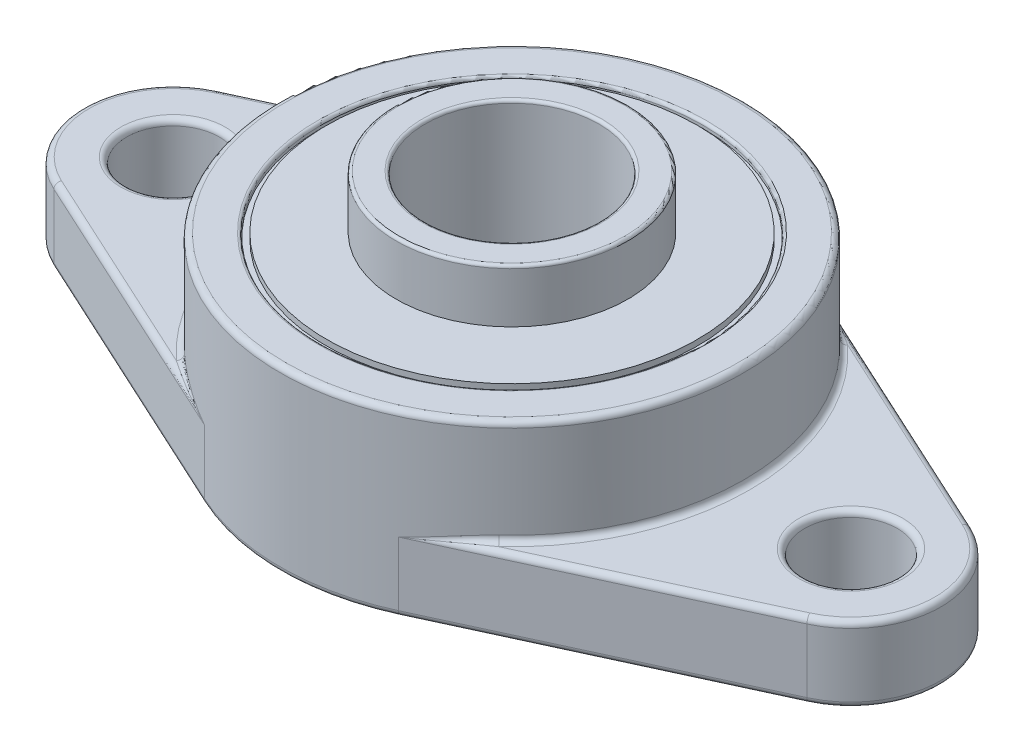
ISO-10303-21;
HEADER;
FILE_DESCRIPTION(('STEP AP214'),'2;1');
FILE_NAME('part.step','',(''),(''),'','','');
FILE_SCHEMA(('AUTOMOTIVE_DESIGN { 1 0 10303 214 1 1 1 1 }'));
ENDSEC;
DATA;
#1=APPLICATION_CONTEXT('core data for automotive mechanical design processes');
#2=APPLICATION_PROTOCOL_DEFINITION('international standard','automotive_design',2000,#1);
#3=PRODUCT_CONTEXT('',#1,'mechanical');
#4=PRODUCT('Part','Part','',(#3));
#5=PRODUCT_RELATED_PRODUCT_CATEGORY('part','',(#4));
#6=PRODUCT_DEFINITION_FORMATION('','',#4);
#7=PRODUCT_DEFINITION_CONTEXT('part definition',#1,'design');
#8=PRODUCT_DEFINITION('design','',#6,#7);
#9=PRODUCT_DEFINITION_SHAPE('','',#8);
#10=(LENGTH_UNIT() NAMED_UNIT(*) SI_UNIT(.MILLI.,.METRE.));
#11=(NAMED_UNIT(*) PLANE_ANGLE_UNIT() SI_UNIT($,.RADIAN.));
#12=(NAMED_UNIT(*) SI_UNIT($,.STERADIAN.) SOLID_ANGLE_UNIT());
#13=UNCERTAINTY_MEASURE_WITH_UNIT(LENGTH_MEASURE(1.E-05),#10,'distance_accuracy_value','');
#14=(GEOMETRIC_REPRESENTATION_CONTEXT(3) GLOBAL_UNCERTAINTY_ASSIGNED_CONTEXT((#13)) GLOBAL_UNIT_ASSIGNED_CONTEXT((#10,
#11,#12)) REPRESENTATION_CONTEXT('',''));
#15=CARTESIAN_POINT('',(0.,0.,0.));
#16=DIRECTION('',(0.,0.,1.));
#17=DIRECTION('',(1.,0.,0.));
#18=AXIS2_PLACEMENT_3D('',#15,#16,#17);
#19=CARTESIAN_POINT('',(0.,-40.555147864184,0.));
#20=DIRECTION('',(0.,-1.,0.));
#21=DIRECTION('',(0.,0.,-1.));
#22=AXIS2_PLACEMENT_3D('',#19,#20,#21);
#23=CYLINDRICAL_SURFACE('',#22,40.);
#24=DIRECTION('',(0.,-1.,0.));
#25=VECTOR('',#24,1.);
#26=CARTESIAN_POINT('',(16.7521367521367,-18.,-36.3230768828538));
#27=LINE('',#26,#25);
#28=CARTESIAN_POINT('',(16.7521367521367,-19.,-36.3230768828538));
#29=VERTEX_POINT('',#28);
#30=CARTESIAN_POINT('',(16.7521367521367,-30.,-36.3230768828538));
#31=VERTEX_POINT('',#30);
#32=EDGE_CURVE('E384',#29,#31,#27,.T.);
#33=ORIENTED_EDGE('',*,*,#32,.T.);
#34=CARTESIAN_POINT('',(0.,-30.,0.));
#35=DIRECTION('',(0.,1.,0.));
#36=DIRECTION('',(0.,0.,1.));
#37=AXIS2_PLACEMENT_3D('',#34,#35,#36);
#38=CIRCLE('',#37,40.);
#39=CARTESIAN_POINT('',(-16.7521367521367,-30.,-36.3230768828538));
#40=VERTEX_POINT('',#39);
#41=EDGE_CURVE('E495',#31,#40,#38,.T.);
#42=ORIENTED_EDGE('',*,*,#41,.T.);
#43=DIRECTION('',(0.,-1.,0.));
#44=VECTOR('',#43,1.);
#45=CARTESIAN_POINT('',(-16.7521367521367,-18.,-36.3230768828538));
#46=LINE('',#45,#44);
#47=CARTESIAN_POINT('',(-16.7521367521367,-19.,-36.3230768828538));
#48=VERTEX_POINT('',#47);
#49=EDGE_CURVE('E423',#48,#40,#46,.T.);
#50=ORIENTED_EDGE('',*,*,#49,.F.);
#51=CARTESIAN_POINT('',(-28.9636201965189,-18.0280784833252,-29.3308099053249));
#52=CARTESIAN_POINT('',(-28.0876954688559,-18.3040116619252,-28.4796775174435));
#53=CARTESIAN_POINT('',(-28.1610473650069,-17.0561569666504,-28.4069606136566));
#54=CARTESIAN_POINT('',(-28.7754080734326,-18.0181615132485,-29.4629374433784));
#55=CARTESIAN_POINT('',(-27.9415292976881,-18.2372181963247,-28.6238056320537));
#56=CARTESIAN_POINT('',(-27.9942425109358,-17.0363230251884,-28.5723286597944));
#57=CARTESIAN_POINT('',(-28.585809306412,-18.0111388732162,-29.5946755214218));
#58=CARTESIAN_POINT('',(-27.7868466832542,-18.178550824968,-28.7740350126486));
#59=CARTESIAN_POINT('',(-27.8257030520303,-17.0222777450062,-28.7364889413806));
#60=CARTESIAN_POINT('',(-28.204377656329,-18.002059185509,-29.8569943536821));
#61=CARTESIAN_POINT('',(-27.470570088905,-18.0784139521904,-29.0759880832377));
#62=CARTESIAN_POINT('',(-27.485632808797,-17.0041183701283,-29.0619204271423));
#63=CARTESIAN_POINT('',(-28.0125469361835,-17.9999976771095,-29.9875760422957));
#64=CARTESIAN_POINT('',(-27.3086400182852,-18.0360510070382,-29.2282398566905));
#65=CARTESIAN_POINT('',(-27.3141048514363,-16.9999953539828,-29.2231940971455));
#66=CARTESIAN_POINT('',(-27.5522077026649,-18.000003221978,-30.2977336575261));
#67=CARTESIAN_POINT('',(-26.9184596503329,-17.952057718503,-29.5886575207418));
#68=CARTESIAN_POINT('',(-26.901298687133,-17.0000064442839,-29.6045063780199));
#69=CARTESIAN_POINT('',(-27.2827591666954,-18.0039770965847,-30.4767103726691));
#70=CARTESIAN_POINT('',(-26.6842816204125,-17.9149308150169,-29.8002399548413));
#71=CARTESIAN_POINT('',(-26.6587202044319,-17.0079541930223,-29.8231295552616));
#72=CARTESIAN_POINT('',(-26.7405189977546,-18.0183456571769,-30.8318044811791));
#73=CARTESIAN_POINT('',(-26.2085245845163,-17.8613400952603,-30.2193958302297));
#74=CARTESIAN_POINT('',(-26.1686687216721,-17.0366913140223,-30.2540456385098));
#75=CARTESIAN_POINT('',(-26.4677266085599,-18.0287418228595,-31.007921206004));
#76=CARTESIAN_POINT('',(-25.9660319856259,-17.84394428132,-30.4281802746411));
#77=CARTESIAN_POINT('',(-25.9211946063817,-17.057483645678,-30.4663370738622));
#78=CARTESIAN_POINT('',(-25.9188415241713,-18.0548248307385,-31.3572942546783));
#79=CARTESIAN_POINT('',(-25.4747425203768,-17.8253126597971,-30.8405763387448));
#80=CARTESIAN_POINT('',(-25.421400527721,-17.109649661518,-30.884603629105));
#81=CARTESIAN_POINT('',(-25.6427445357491,-18.0705194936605,-31.5305459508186));
#82=CARTESIAN_POINT('',(-25.2250842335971,-17.8235344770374,-31.0452363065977));
#83=CARTESIAN_POINT('',(-25.1690739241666,-17.1410389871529,-31.0905689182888));
#84=CARTESIAN_POINT('',(-25.0879150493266,-18.1062961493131,-31.8737939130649));
#85=CARTESIAN_POINT('',(-24.7206568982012,-17.8329040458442,-31.4483037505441));
#86=CARTESIAN_POINT('',(-24.6601906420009,-17.2125922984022,-31.4957266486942));
#87=CARTESIAN_POINT('',(-24.8091823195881,-18.1263785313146,-32.0437898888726));
#88=CARTESIAN_POINT('',(-24.4651110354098,-17.8437162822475,-31.6476138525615));
#89=CARTESIAN_POINT('',(-24.4036335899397,-17.2527570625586,-31.6949184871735));
#90=CARTESIAN_POINT('',(-24.112494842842,-18.1808972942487,-32.462691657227));
#91=CARTESIAN_POINT('',(-23.8271734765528,-17.883379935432,-32.1324645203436));
#92=CARTESIAN_POINT('',(-23.7601475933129,-17.3617945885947,-32.1821140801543));
#93=CARTESIAN_POINT('',(-23.6930657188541,-18.2175524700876,-32.7095646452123));
#94=CARTESIAN_POINT('',(-23.4363806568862,-17.918298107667,-32.4188329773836));
#95=CARTESIAN_POINT('',(-23.3707737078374,-17.435104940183,-32.4659521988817));
#96=CARTESIAN_POINT('',(-22.849334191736,-18.2970054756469,-33.1957395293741));
#97=CARTESIAN_POINT('',(-22.6468481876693,-18.0051325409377,-32.9750277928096));
#98=CARTESIAN_POINT('',(-22.5836285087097,-17.5940109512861,-33.0183429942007));
#99=CARTESIAN_POINT('',(-22.4250310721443,-18.3398042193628,-33.4350402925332));
#100=CARTESIAN_POINT('',(-22.2459267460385,-18.0568664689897,-33.2469709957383));
#101=CARTESIAN_POINT('',(-22.1858559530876,-17.6796084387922,-33.2868933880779));
#102=CARTESIAN_POINT('',(-21.5721819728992,-18.4299664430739,-33.9058320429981));
#103=CARTESIAN_POINT('',(-21.437139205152,-18.1725235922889,-33.7739658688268));
#104=CARTESIAN_POINT('',(-21.3825477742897,-17.8599328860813,-33.8085177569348));
#105=CARTESIAN_POINT('',(-21.1436384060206,-18.4773274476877,-34.1373271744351));
#106=CARTESIAN_POINT('',(-21.0272374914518,-18.2365088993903,-34.0307819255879));
#107=CARTESIAN_POINT('',(-20.9770164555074,-17.9546548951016,-34.0616000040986));
#108=CARTESIAN_POINT('',(-20.2823472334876,-18.5753213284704,-34.5925929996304));
#109=CARTESIAN_POINT('',(-20.2008377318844,-18.3728942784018,-34.5276319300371));
#110=CARTESIAN_POINT('',(-20.1582669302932,-18.1506426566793,-34.5524543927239));
#111=CARTESIAN_POINT('',(-19.8495995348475,-18.6259542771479,-34.8163635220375));
#112=CARTESIAN_POINT('',(-19.7823730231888,-18.4455137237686,-34.7691461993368));
#113=CARTESIAN_POINT('',(-19.7450485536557,-18.2519085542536,-34.7902261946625));
#114=CARTESIAN_POINT('',(-18.9808508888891,-18.7292466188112,-35.2557640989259));
#115=CARTESIAN_POINT('',(-18.9400075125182,-18.5958417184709,-35.2350123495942));
#116=CARTESIAN_POINT('',(-18.9118608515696,-18.4584932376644,-35.250071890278));
#117=CARTESIAN_POINT('',(-18.5448565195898,-18.7819025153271,-35.4714070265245));
#118=CARTESIAN_POINT('',(-18.5141968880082,-18.6738458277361,-35.4606420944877));
#119=CARTESIAN_POINT('',(-18.4919038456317,-18.5638050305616,-35.4721711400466));
#120=CARTESIAN_POINT('',(-17.6691801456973,-18.8882472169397,-35.8948486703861));
#121=CARTESIAN_POINT('',(-17.6569580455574,-18.8321995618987,-35.8951486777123));
#122=CARTESIAN_POINT('',(-17.6448506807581,-18.7764944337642,-35.9010379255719));
#123=CARTESIAN_POINT('',(-17.2294991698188,-18.941935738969,-36.1026494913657));
#124=CARTESIAN_POINT('',(-17.2236006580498,-18.9128990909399,-36.1051002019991));
#125=CARTESIAN_POINT('',(-17.2177564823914,-18.883871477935,-36.1078095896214));
#126=CARTESIAN_POINT('',(-16.7760746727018,-18.9970887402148,-36.3120332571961));
#127=CARTESIAN_POINT('',(-16.7757814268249,-18.9956331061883,-36.312165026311));
#128=CARTESIAN_POINT('',(-16.7754895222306,-18.9941774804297,-36.3122997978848));
#129=CARTESIAN_POINT('',(-16.7641063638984,-18.9985443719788,-36.317556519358));
#130=CARTESIAN_POINT('',(-16.763960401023,-18.9978165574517,-36.3176238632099));
#131=CARTESIAN_POINT('',(-16.7638144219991,-18.9970887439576,-36.3176911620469));
#132=CARTESIAN_POINT('',(-16.7521367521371,-19.,-36.3230768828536));
#133=CARTESIAN_POINT('',(-16.7521367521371,-19.,-36.3230768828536));
#134=CARTESIAN_POINT('',(-16.7521367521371,-19.,-36.3230768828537));
#135=(BOUNDED_SURFACE() B_SPLINE_SURFACE(3,2,((#51,#52,#53),(#54,#55,#56),(#57,#58,#59),(#60,
#61,#62),(#63,#64,#65),(#66,#67,#68),(#69,#70,#71),(#72,#73,#74),(#75,#76,#77),(#78,#79,#80),
(#81,#82,#83),(#84,#85,#86),(#87,#88,#89),(#90,#91,#92),(#93,#94,#95),(#96,#97,#98),(#99,#100,
#101),(#102,#103,#104),(#105,#106,#107),(#108,#109,#110),(#111,#112,#113),(#114,#115,#116),
(#117,#118,#119),(#120,#121,#122),(#123,#124,#125),(#126,#127,#128),(#129,#130,#131),(#132,#133,
#134)),.UNSPECIFIED.,.F.,.F.,.F.) B_SPLINE_SURFACE_WITH_KNOTS((4,2,2,2,2,2,2,2,2,2,2,2,2,4),(3,
3),(0.,0.724508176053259,1.4483646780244,2.45239384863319,3.45665443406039,4.46240386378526,
5.46824255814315,6.9655917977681,8.46316403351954,9.95992824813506,11.4567256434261,
12.9510430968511,14.444956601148,14.4854535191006),(0.,1.),
.UNSPECIFIED.) GEOMETRIC_REPRESENTATION_ITEM() RATIONAL_B_SPLINE_SURFACE(((1.,0.624048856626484,
1.),(1.,0.639340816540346,1.),(1.,0.653849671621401,1.),(1.,0.681473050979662,1.),(1.,
0.694588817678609,1.),(1.,0.724469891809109,1.),(1.,0.740682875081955,1.),(1.,0.771140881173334,
1.),(1.,0.785385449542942,1.),(1.,0.812163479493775,1.),(1.,0.824694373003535,1.),(1.,
0.848199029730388,1.),(1.,0.85917265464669,1.),(1.,0.88471537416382,1.),(1.,0.898421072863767,
1.),(1.,0.923011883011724,1.),(1.,0.933896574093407,1.),(1.,0.953059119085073,1.),(1.,
0.961338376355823,1.),(1.,0.975449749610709,1.),(1.,0.981281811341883,1.),(1.,0.990589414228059,
1.),(1.,0.994068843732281,1.),(1.,0.998741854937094,1.),(1.,0.999936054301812,1.),(1.,
0.999999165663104,1.),(1.,0.999999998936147,1.),(1.,1.,1.))) REPRESENTATION_ITEM('') SURFACE());
#136=CARTESIAN_POINT('',(-28.1610473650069,-17.0561569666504,-28.4069606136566));
#137=CARTESIAN_POINT('',(-27.9942425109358,-17.0363230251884,-28.5723286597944));
#138=CARTESIAN_POINT('',(-27.8257030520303,-17.0222777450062,-28.7364889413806));
#139=CARTESIAN_POINT('',(-27.485632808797,-17.0041183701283,-29.0619204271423));
#140=CARTESIAN_POINT('',(-27.3141048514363,-16.9999953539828,-29.2231940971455));
#141=CARTESIAN_POINT('',(-26.901298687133,-17.0000064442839,-29.6045063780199));
#142=CARTESIAN_POINT('',(-26.6587202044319,-17.0079541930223,-29.8231295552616));
#143=CARTESIAN_POINT('',(-26.1686687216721,-17.0366913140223,-30.2540456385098));
#144=CARTESIAN_POINT('',(-25.9211946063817,-17.057483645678,-30.4663370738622));
#145=CARTESIAN_POINT('',(-25.421400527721,-17.109649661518,-30.884603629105));
#146=CARTESIAN_POINT('',(-25.1690739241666,-17.1410389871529,-31.0905689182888));
#147=CARTESIAN_POINT('',(-24.6601906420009,-17.2125922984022,-31.4957266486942));
#148=CARTESIAN_POINT('',(-24.4036335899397,-17.2527570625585,-31.6949184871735));
#149=CARTESIAN_POINT('',(-23.7601475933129,-17.3617945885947,-32.1821140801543));
#150=CARTESIAN_POINT('',(-23.3707737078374,-17.435104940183,-32.4659521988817));
#151=CARTESIAN_POINT('',(-22.5836285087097,-17.5940109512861,-33.0183429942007));
#152=CARTESIAN_POINT('',(-22.1858559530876,-17.6796084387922,-33.2868933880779));
#153=CARTESIAN_POINT('',(-21.3825477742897,-17.8599328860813,-33.8085177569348));
#154=CARTESIAN_POINT('',(-20.9770164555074,-17.9546548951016,-34.0616000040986));
#155=CARTESIAN_POINT('',(-20.1582669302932,-18.1506426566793,-34.5524543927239));
#156=CARTESIAN_POINT('',(-19.7450485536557,-18.2519085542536,-34.7902261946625));
#157=CARTESIAN_POINT('',(-18.9118608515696,-18.4584932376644,-35.250071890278));
#158=CARTESIAN_POINT('',(-18.4919038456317,-18.5638050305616,-35.4721711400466));
#159=CARTESIAN_POINT('',(-17.6448506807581,-18.7764944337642,-35.9010379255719));
#160=CARTESIAN_POINT('',(-17.2177564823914,-18.883871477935,-36.1078095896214));
#161=CARTESIAN_POINT('',(-16.7754895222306,-18.9941774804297,-36.3122997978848));
#162=CARTESIAN_POINT('',(-16.7638144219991,-18.9970887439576,-36.3176911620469));
#163=CARTESIAN_POINT('',(-16.7521367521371,-19.,-36.3230768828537));
#164=B_SPLINE_CURVE_WITH_KNOTS('',3,(#136,#137,#138,#139,#140,#141,#142,#143,#144,#145,#146,
#147,#148,#149,#150,#151,#152,#153,#154,#155,#156,#157,#158,#159,#160,#161,#162,#163),
.UNSPECIFIED.,.F.,.F.,(4,2,2,2,2,2,2,2,2,2,2,2,2,4),(0.,0.724508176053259,1.4483646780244,
2.45239384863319,3.45665443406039,4.46240386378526,5.46824255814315,6.9655917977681,
8.46316403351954,9.95992824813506,11.4567256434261,12.9510430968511,14.444956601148,
14.4854535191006),.UNSPECIFIED.);
#165=CARTESIAN_POINT('',(-27.1411695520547,-17.,-29.3829357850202));
#166=VERTEX_POINT('',#165);
#167=EDGE_CURVE('E283',#48,#166,#164,.F.);
#168=ORIENTED_EDGE('',*,*,#167,.T.);
#169=CARTESIAN_POINT('',(0.,-17.,0.));
#170=DIRECTION('',(0.,1.,0.));
#171=DIRECTION('',(0.,0.,1.));
#172=AXIS2_PLACEMENT_3D('',#169,#170,#171);
#173=CIRCLE('',#172,40.);
#174=CARTESIAN_POINT('',(-27.1411695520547,-17.,29.3829357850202));
#175=VERTEX_POINT('',#174);
#176=EDGE_CURVE('E393',#166,#175,#173,.T.);
#177=ORIENTED_EDGE('',*,*,#176,.T.);
#178=CARTESIAN_POINT('',(-28.1610473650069,-17.0561569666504,28.4069606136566));
#179=CARTESIAN_POINT('',(-28.0876954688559,-18.3040116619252,28.4796775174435));
#180=CARTESIAN_POINT('',(-28.9636201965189,-18.0280784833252,29.330809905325));
#181=CARTESIAN_POINT('',(-27.9942425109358,-17.0363230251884,28.5723286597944));
#182=CARTESIAN_POINT('',(-27.9415292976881,-18.2372181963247,28.6238056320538));
#183=CARTESIAN_POINT('',(-28.7754080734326,-18.0181615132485,29.4629374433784));
#184=CARTESIAN_POINT('',(-27.8257030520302,-17.0222777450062,28.7364889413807));
#185=CARTESIAN_POINT('',(-27.7868466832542,-18.178550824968,28.7740350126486));
#186=CARTESIAN_POINT('',(-28.585809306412,-18.0111388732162,29.5946755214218));
#187=CARTESIAN_POINT('',(-27.485632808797,-17.0041183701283,29.0619204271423));
#188=CARTESIAN_POINT('',(-27.4705700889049,-18.0784139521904,29.0759880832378));
#189=CARTESIAN_POINT('',(-28.2043776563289,-18.002059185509,29.8569943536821));
#190=CARTESIAN_POINT('',(-27.3141048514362,-16.9999953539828,29.2231940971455));
#191=CARTESIAN_POINT('',(-27.3086400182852,-18.0360510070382,29.2282398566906));
#192=CARTESIAN_POINT('',(-28.0125469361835,-17.9999976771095,29.9875760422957));
#193=CARTESIAN_POINT('',(-26.901298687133,-17.0000064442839,29.6045063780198));
#194=CARTESIAN_POINT('',(-26.9184596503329,-17.9520577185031,29.5886575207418));
#195=CARTESIAN_POINT('',(-27.5522077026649,-18.000003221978,30.297733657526));
#196=CARTESIAN_POINT('',(-26.6587202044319,-17.0079541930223,29.8231295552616));
#197=CARTESIAN_POINT('',(-26.6842816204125,-17.9149308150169,29.8002399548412));
#198=CARTESIAN_POINT('',(-27.2827591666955,-18.0039770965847,30.4767103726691));
#199=CARTESIAN_POINT('',(-26.1686687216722,-17.0366913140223,30.2540456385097));
#200=CARTESIAN_POINT('',(-26.2085245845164,-17.8613400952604,30.2193958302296));
#201=CARTESIAN_POINT('',(-26.7405189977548,-18.0183456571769,30.831804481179));
#202=CARTESIAN_POINT('',(-25.9211946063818,-17.057483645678,30.4663370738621));
#203=CARTESIAN_POINT('',(-25.966031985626,-17.84394428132,30.428180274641));
#204=CARTESIAN_POINT('',(-26.4677266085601,-18.0287418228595,31.0079212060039));
#205=CARTESIAN_POINT('',(-25.4214005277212,-17.109649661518,30.8846036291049));
#206=CARTESIAN_POINT('',(-25.4747425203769,-17.8253126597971,30.8405763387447));
#207=CARTESIAN_POINT('',(-25.9188415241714,-18.0548248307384,31.3572942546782));
#208=CARTESIAN_POINT('',(-25.1690739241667,-17.1410389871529,31.0905689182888));
#209=CARTESIAN_POINT('',(-25.2250842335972,-17.8235344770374,31.0452363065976));
#210=CARTESIAN_POINT('',(-25.6427445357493,-18.0705194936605,31.5305459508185));
#211=CARTESIAN_POINT('',(-24.660190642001,-17.2125922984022,31.4957266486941));
#212=CARTESIAN_POINT('',(-24.7206568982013,-17.8329040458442,31.448303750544));
#213=CARTESIAN_POINT('',(-25.0879150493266,-18.1062961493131,31.8737939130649));
#214=CARTESIAN_POINT('',(-24.4036335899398,-17.2527570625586,31.6949184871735));
#215=CARTESIAN_POINT('',(-24.4651110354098,-17.8437162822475,31.6476138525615));
#216=CARTESIAN_POINT('',(-24.8091823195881,-18.1263785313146,32.0437898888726));
#217=CARTESIAN_POINT('',(-23.7601475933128,-17.3617945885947,32.1821140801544));
#218=CARTESIAN_POINT('',(-23.8271734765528,-17.8833799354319,32.1324645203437));
#219=CARTESIAN_POINT('',(-24.1124948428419,-18.1808972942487,32.4626916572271));
#220=CARTESIAN_POINT('',(-23.3707737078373,-17.435104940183,32.4659521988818));
#221=CARTESIAN_POINT('',(-23.4363806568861,-17.918298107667,32.4188329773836));
#222=CARTESIAN_POINT('',(-23.693065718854,-18.2175524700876,32.7095646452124));
#223=CARTESIAN_POINT('',(-22.5836285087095,-17.5940109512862,33.0183429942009));
#224=CARTESIAN_POINT('',(-22.6468481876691,-18.0051325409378,32.9750277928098));
#225=CARTESIAN_POINT('',(-22.8493341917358,-18.2970054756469,33.1957395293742));
#226=CARTESIAN_POINT('',(-22.1858559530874,-17.6796084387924,33.2868933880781));
#227=CARTESIAN_POINT('',(-22.2459267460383,-18.0568664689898,33.2469709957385));
#228=CARTESIAN_POINT('',(-22.4250310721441,-18.3398042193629,33.4350402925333));
#229=CARTESIAN_POINT('',(-21.3825477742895,-17.8599328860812,33.8085177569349));
#230=CARTESIAN_POINT('',(-21.4371392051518,-18.1725235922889,33.773965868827));
#231=CARTESIAN_POINT('',(-21.572181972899,-18.4299664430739,33.9058320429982));
#232=CARTESIAN_POINT('',(-20.9770164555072,-17.9546548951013,34.0616000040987));
#233=CARTESIAN_POINT('',(-21.0272374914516,-18.23650889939,34.030781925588));
#234=CARTESIAN_POINT('',(-21.1436384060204,-18.4773274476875,34.1373271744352));
#235=CARTESIAN_POINT('',(-20.1582669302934,-18.1506426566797,34.5524543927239));
#236=CARTESIAN_POINT('',(-20.2008377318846,-18.3728942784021,34.527631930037));
#237=CARTESIAN_POINT('',(-20.2823472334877,-18.5753213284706,34.5925929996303));
#238=CARTESIAN_POINT('',(-19.7450485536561,-18.251908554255,34.7902261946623));
#239=CARTESIAN_POINT('',(-19.7823730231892,-18.4455137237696,34.7691461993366));
#240=CARTESIAN_POINT('',(-19.8495995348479,-18.6259542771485,34.8163635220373));
#241=CARTESIAN_POINT('',(-18.9118608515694,-18.458493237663,35.2500718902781));
#242=CARTESIAN_POINT('',(-18.9400075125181,-18.5958417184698,35.2350123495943));
#243=CARTESIAN_POINT('',(-18.980850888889,-18.7292466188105,35.255764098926));
#244=CARTESIAN_POINT('',(-18.4919038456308,-18.5638050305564,35.472171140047));
#245=CARTESIAN_POINT('',(-18.5141968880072,-18.6738458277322,35.4606420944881));
#246=CARTESIAN_POINT('',(-18.5448565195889,-18.7819025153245,35.4714070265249));
#247=CARTESIAN_POINT('',(-17.644850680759,-18.7764944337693,35.9010379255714));
#248=CARTESIAN_POINT('',(-17.6569580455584,-18.8321995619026,35.8951486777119));
#249=CARTESIAN_POINT('',(-17.6691801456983,-18.8882472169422,35.8948486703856));
#250=CARTESIAN_POINT('',(-17.2177564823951,-18.8838714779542,36.1078095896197));
#251=CARTESIAN_POINT('',(-17.2236006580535,-18.9128990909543,36.1051002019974));
#252=CARTESIAN_POINT('',(-17.2294991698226,-18.9419357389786,36.102649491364));
#253=CARTESIAN_POINT('',(-16.7754895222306,-18.9941774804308,36.3122997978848));
#254=CARTESIAN_POINT('',(-16.7757814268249,-18.9956331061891,36.312165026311));
#255=CARTESIAN_POINT('',(-16.7760746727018,-18.9970887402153,36.3120332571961));
#256=CARTESIAN_POINT('',(-16.763814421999,-18.9970887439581,36.3176911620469));
#257=CARTESIAN_POINT('',(-16.7639604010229,-18.9978165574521,36.31762386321));
#258=CARTESIAN_POINT('',(-16.7641063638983,-18.998544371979,36.3175565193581));
#259=CARTESIAN_POINT('',(-16.7521367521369,-19.,36.3230768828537));
#260=CARTESIAN_POINT('',(-16.7521367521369,-19.,36.3230768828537));
#261=CARTESIAN_POINT('',(-16.7521367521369,-19.,36.3230768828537));
#262=(BOUNDED_SURFACE() B_SPLINE_SURFACE(3,2,((#178,#179,#180),(#181,#182,#183),(#184,#185,
#186),(#187,#188,#189),(#190,#191,#192),(#193,#194,#195),(#196,#197,#198),(#199,#200,#201),
(#202,#203,#204),(#205,#206,#207),(#208,#209,#210),(#211,#212,#213),(#214,#215,#216),(#217,#218,
#219),(#220,#221,#222),(#223,#224,#225),(#226,#227,#228),(#229,#230,#231),(#232,#233,#234),
(#235,#236,#237),(#238,#239,#240),(#241,#242,#243),(#244,#245,#246),(#247,#248,#249),(#250,#251,
#252),(#253,#254,#255),(#256,#257,#258),(#259,#260,#261)),.UNSPECIFIED.,.F.,.F.,
.F.) B_SPLINE_SURFACE_WITH_KNOTS((4,2,2,2,2,2,2,2,2,2,2,2,2,4),(3,3),(0.,0.724508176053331,
1.44836467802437,2.45239384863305,3.45665443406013,4.46240386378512,5.46824255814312,
6.96559179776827,8.46316403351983,9.95992824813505,11.4567256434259,12.9510430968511,
14.4449566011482,14.4854535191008),(0.,1.),
.UNSPECIFIED.) GEOMETRIC_REPRESENTATION_ITEM() RATIONAL_B_SPLINE_SURFACE(((1.,0.624048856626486,
1.),(1.,0.639340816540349,1.),(1.,0.653849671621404,1.),(1.,0.681473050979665,1.),(1.,
0.69458881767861,1.),(1.,0.724469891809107,1.),(1.,0.740682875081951,1.),(1.,0.771140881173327,
1.),(1.,0.785385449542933,1.),(1.,0.812163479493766,1.),(1.,0.824694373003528,1.),(1.,
0.848199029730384,1.),(1.,0.859172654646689,1.),(1.,0.884715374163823,1.),(1.,0.89842107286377,
1.),(1.,0.923011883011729,1.),(1.,0.933896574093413,1.),(1.,0.953059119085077,1.),(1.,
0.961338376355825,1.),(1.,0.975449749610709,1.),(1.,0.981281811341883,1.),(1.,0.990589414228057,
1.),(1.,0.994068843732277,1.),(1.,0.998741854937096,1.),(1.,0.999936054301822,1.),(1.,
0.999999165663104,1.),(1.,0.999999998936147,1.),(1.,1.,1.))) REPRESENTATION_ITEM('') SURFACE());
#263=CARTESIAN_POINT('',(-28.1610473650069,-17.0561569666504,28.4069606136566));
#264=CARTESIAN_POINT('',(-27.9942425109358,-17.0363230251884,28.5723286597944));
#265=CARTESIAN_POINT('',(-27.8257030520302,-17.0222777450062,28.7364889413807));
#266=CARTESIAN_POINT('',(-27.485632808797,-17.0041183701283,29.0619204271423));
#267=CARTESIAN_POINT('',(-27.3141048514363,-16.9999953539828,29.2231940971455));
#268=CARTESIAN_POINT('',(-26.901298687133,-17.0000064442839,29.6045063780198));
#269=CARTESIAN_POINT('',(-26.6587202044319,-17.0079541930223,29.8231295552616));
#270=CARTESIAN_POINT('',(-26.1686687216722,-17.0366913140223,30.2540456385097));
#271=CARTESIAN_POINT('',(-25.9211946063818,-17.057483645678,30.4663370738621));
#272=CARTESIAN_POINT('',(-25.4214005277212,-17.109649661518,30.8846036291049));
#273=CARTESIAN_POINT('',(-25.1690739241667,-17.1410389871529,31.0905689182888));
#274=CARTESIAN_POINT('',(-24.660190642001,-17.2125922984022,31.4957266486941));
#275=CARTESIAN_POINT('',(-24.4036335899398,-17.2527570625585,31.6949184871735));
#276=CARTESIAN_POINT('',(-23.7601475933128,-17.3617945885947,32.1821140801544));
#277=CARTESIAN_POINT('',(-23.3707737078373,-17.435104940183,32.4659521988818));
#278=CARTESIAN_POINT('',(-22.5836285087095,-17.5940109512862,33.0183429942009));
#279=CARTESIAN_POINT('',(-22.1858559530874,-17.6796084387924,33.2868933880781));
#280=CARTESIAN_POINT('',(-21.3825477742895,-17.8599328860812,33.8085177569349));
#281=CARTESIAN_POINT('',(-20.9770164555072,-17.9546548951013,34.0616000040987));
#282=CARTESIAN_POINT('',(-20.1582669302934,-18.1506426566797,34.5524543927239));
#283=CARTESIAN_POINT('',(-19.7450485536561,-18.251908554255,34.7902261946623));
#284=CARTESIAN_POINT('',(-18.9118608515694,-18.458493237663,35.2500718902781));
#285=CARTESIAN_POINT('',(-18.4919038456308,-18.5638050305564,35.4721711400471));
#286=CARTESIAN_POINT('',(-17.644850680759,-18.7764944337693,35.9010379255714));
#287=CARTESIAN_POINT('',(-17.2177564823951,-18.8838714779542,36.1078095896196));
#288=CARTESIAN_POINT('',(-16.7754895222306,-18.9941774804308,36.3122997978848));
#289=CARTESIAN_POINT('',(-16.763814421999,-18.9970887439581,36.3176911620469));
#290=CARTESIAN_POINT('',(-16.7521367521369,-19.,36.3230768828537));
#291=B_SPLINE_CURVE_WITH_KNOTS('',3,(#263,#264,#265,#266,#267,#268,#269,#270,#271,#272,#273,
#274,#275,#276,#277,#278,#279,#280,#281,#282,#283,#284,#285,#286,#287,#288,#289,#290),
.UNSPECIFIED.,.F.,.F.,(4,2,2,2,2,2,2,2,2,2,2,2,2,4),(0.,0.724508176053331,1.44836467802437,
2.45239384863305,3.45665443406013,4.46240386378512,5.46824255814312,6.96559179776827,
8.46316403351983,9.95992824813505,11.4567256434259,12.9510430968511,14.4449566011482,
14.4854535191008),.UNSPECIFIED.);
#292=CARTESIAN_POINT('',(-16.7521367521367,-19.,36.3230768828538));
#293=VERTEX_POINT('',#292);
#294=EDGE_CURVE('E288',#175,#293,#291,.T.);
#295=ORIENTED_EDGE('',*,*,#294,.T.);
#296=DIRECTION('',(0.,-1.,0.));
#297=VECTOR('',#296,1.);
#298=CARTESIAN_POINT('',(-16.7521367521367,-18.,36.3230768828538));
#299=LINE('',#298,#297);
#300=CARTESIAN_POINT('',(-16.7521367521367,-30.,36.3230768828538));
#301=VERTEX_POINT('',#300);
#302=EDGE_CURVE('E428',#293,#301,#299,.T.);
#303=ORIENTED_EDGE('',*,*,#302,.T.);
#304=CARTESIAN_POINT('',(0.,-30.,0.));
#305=DIRECTION('',(0.,1.,0.));
#306=DIRECTION('',(0.,0.,1.));
#307=AXIS2_PLACEMENT_3D('',#304,#305,#306);
#308=CIRCLE('',#307,40.);
#309=CARTESIAN_POINT('',(16.7521367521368,-30.,36.3230768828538));
#310=VERTEX_POINT('',#309);
#311=EDGE_CURVE('E493',#301,#310,#308,.T.);
#312=ORIENTED_EDGE('',*,*,#311,.T.);
#313=DIRECTION('',(0.,-1.,0.));
#314=VECTOR('',#313,1.);
#315=CARTESIAN_POINT('',(16.7521367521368,-18.,36.3230768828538));
#316=LINE('',#315,#314);
#317=CARTESIAN_POINT('',(16.7521367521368,-19.,36.3230768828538));
#318=VERTEX_POINT('',#317);
#319=EDGE_CURVE('E186',#318,#310,#316,.T.);
#320=ORIENTED_EDGE('',*,*,#319,.F.);
#321=CARTESIAN_POINT('',(28.9636201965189,-18.0280784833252,29.330809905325));
#322=CARTESIAN_POINT('',(28.0876954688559,-18.3040116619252,28.4796775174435));
#323=CARTESIAN_POINT('',(28.1610473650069,-17.0561569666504,28.4069606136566));
#324=CARTESIAN_POINT('',(28.7754080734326,-18.0181615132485,29.4629374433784));
#325=CARTESIAN_POINT('',(27.9415292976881,-18.2372181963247,28.6238056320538));
#326=CARTESIAN_POINT('',(27.9942425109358,-17.0363230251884,28.5723286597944));
#327=CARTESIAN_POINT('',(28.585809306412,-18.0111388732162,29.5946755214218));
#328=CARTESIAN_POINT('',(27.7868466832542,-18.178550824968,28.7740350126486));
#329=CARTESIAN_POINT('',(27.8257030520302,-17.0222777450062,28.7364889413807));
#330=CARTESIAN_POINT('',(28.2043776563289,-18.002059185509,29.8569943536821));
#331=CARTESIAN_POINT('',(27.4705700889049,-18.0784139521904,29.0759880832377));
#332=CARTESIAN_POINT('',(27.485632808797,-17.0041183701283,29.0619204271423));
#333=CARTESIAN_POINT('',(28.0125469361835,-17.9999976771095,29.9875760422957));
#334=CARTESIAN_POINT('',(27.3086400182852,-18.0360510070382,29.2282398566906));
#335=CARTESIAN_POINT('',(27.3141048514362,-16.9999953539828,29.2231940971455));
#336=CARTESIAN_POINT('',(27.5522077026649,-18.000003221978,30.2977336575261));
#337=CARTESIAN_POINT('',(26.9184596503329,-17.952057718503,29.5886575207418));
#338=CARTESIAN_POINT('',(26.901298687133,-17.0000064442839,29.6045063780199));
#339=CARTESIAN_POINT('',(27.2827591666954,-18.0039770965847,30.4767103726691));
#340=CARTESIAN_POINT('',(26.6842816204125,-17.9149308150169,29.8002399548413));
#341=CARTESIAN_POINT('',(26.6587202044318,-17.0079541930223,29.8231295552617));
#342=CARTESIAN_POINT('',(26.7405189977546,-18.0183456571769,30.8318044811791));
#343=CARTESIAN_POINT('',(26.2085245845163,-17.8613400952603,30.2193958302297));
#344=CARTESIAN_POINT('',(26.1686687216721,-17.0366913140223,30.2540456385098));
#345=CARTESIAN_POINT('',(26.4677266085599,-18.0287418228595,31.007921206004));
#346=CARTESIAN_POINT('',(25.9660319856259,-17.84394428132,30.4281802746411));
#347=CARTESIAN_POINT('',(25.9211946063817,-17.057483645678,30.4663370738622));
#348=CARTESIAN_POINT('',(25.9188415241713,-18.0548248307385,31.3572942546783));
#349=CARTESIAN_POINT('',(25.4747425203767,-17.8253126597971,30.8405763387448));
#350=CARTESIAN_POINT('',(25.421400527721,-17.109649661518,30.8846036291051));
#351=CARTESIAN_POINT('',(25.6427445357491,-18.0705194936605,31.5305459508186));
#352=CARTESIAN_POINT('',(25.225084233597,-17.8235344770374,31.0452363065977));
#353=CARTESIAN_POINT('',(25.1690739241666,-17.1410389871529,31.0905689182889));
#354=CARTESIAN_POINT('',(25.0879150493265,-18.1062961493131,31.8737939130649));
#355=CARTESIAN_POINT('',(24.7206568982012,-17.8329040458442,31.4483037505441));
#356=CARTESIAN_POINT('',(24.6601906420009,-17.2125922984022,31.4957266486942));
#357=CARTESIAN_POINT('',(24.8091823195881,-18.1263785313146,32.0437898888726));
#358=CARTESIAN_POINT('',(24.4651110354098,-17.8437162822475,31.6476138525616));
#359=CARTESIAN_POINT('',(24.4036335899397,-17.2527570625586,31.6949184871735));
#360=CARTESIAN_POINT('',(24.1124948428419,-18.1808972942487,32.462691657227));
#361=CARTESIAN_POINT('',(23.8271734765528,-17.8833799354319,32.1324645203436));
#362=CARTESIAN_POINT('',(23.7601475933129,-17.3617945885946,32.1821140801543));
#363=CARTESIAN_POINT('',(23.6930657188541,-18.2175524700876,32.7095646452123));
#364=CARTESIAN_POINT('',(23.4363806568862,-17.918298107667,32.4188329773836));
#365=CARTESIAN_POINT('',(23.3707737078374,-17.435104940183,32.4659521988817));
#366=CARTESIAN_POINT('',(22.849334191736,-18.2970054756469,33.1957395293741));
#367=CARTESIAN_POINT('',(22.6468481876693,-18.0051325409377,32.9750277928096));
#368=CARTESIAN_POINT('',(22.5836285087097,-17.5940109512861,33.0183429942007));
#369=CARTESIAN_POINT('',(22.4250310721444,-18.3398042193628,33.4350402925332));
#370=CARTESIAN_POINT('',(22.2459267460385,-18.0568664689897,33.2469709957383));
#371=CARTESIAN_POINT('',(22.1858559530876,-17.6796084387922,33.2868933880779));
#372=CARTESIAN_POINT('',(21.5721819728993,-18.4299664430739,33.9058320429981));
#373=CARTESIAN_POINT('',(21.437139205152,-18.1725235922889,33.7739658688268));
#374=CARTESIAN_POINT('',(21.3825477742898,-17.8599328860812,33.8085177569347));
#375=CARTESIAN_POINT('',(21.1436384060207,-18.4773274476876,34.1373271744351));
#376=CARTESIAN_POINT('',(21.0272374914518,-18.2365088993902,34.0307819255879));
#377=CARTESIAN_POINT('',(20.9770164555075,-17.9546548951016,34.0616000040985));
#378=CARTESIAN_POINT('',(20.2823472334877,-18.5753213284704,34.5925929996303));
#379=CARTESIAN_POINT('',(20.2008377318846,-18.3728942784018,34.527631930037));
#380=CARTESIAN_POINT('',(20.1582669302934,-18.1506426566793,34.5524543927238));
#381=CARTESIAN_POINT('',(19.8495995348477,-18.6259542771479,34.8163635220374));
#382=CARTESIAN_POINT('',(19.782373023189,-18.4455137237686,34.7691461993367));
#383=CARTESIAN_POINT('',(19.7450485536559,-18.2519085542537,34.7902261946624));
#384=CARTESIAN_POINT('',(18.9808508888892,-18.7292466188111,35.2557640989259));
#385=CARTESIAN_POINT('',(18.9400075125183,-18.5958417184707,35.2350123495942));
#386=CARTESIAN_POINT('',(18.9118608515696,-18.4584932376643,35.250071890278));
#387=CARTESIAN_POINT('',(18.5448565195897,-18.7819025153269,35.4714070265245));
#388=CARTESIAN_POINT('',(18.514196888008,-18.6738458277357,35.4606420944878));
#389=CARTESIAN_POINT('',(18.4919038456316,-18.5638050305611,35.4721711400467));
#390=CARTESIAN_POINT('',(17.6691801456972,-18.8882472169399,35.8948486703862));
#391=CARTESIAN_POINT('',(17.6569580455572,-18.832199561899,35.8951486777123));
#392=CARTESIAN_POINT('',(17.6448506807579,-18.7764944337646,35.901037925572));
#393=CARTESIAN_POINT('',(17.2294991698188,-18.9419357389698,36.1026494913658));
#394=CARTESIAN_POINT('',(17.2236006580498,-18.9128990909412,36.105100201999));
#395=CARTESIAN_POINT('',(17.2177564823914,-18.8838714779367,36.1078095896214));
#396=CARTESIAN_POINT('',(16.7760746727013,-18.9970887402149,36.3120332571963));
#397=CARTESIAN_POINT('',(16.7757814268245,-18.9956331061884,36.3121650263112));
#398=CARTESIAN_POINT('',(16.7754895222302,-18.9941774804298,36.312299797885));
#399=CARTESIAN_POINT('',(16.764106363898,-18.9985443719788,36.3175565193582));
#400=CARTESIAN_POINT('',(16.7639604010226,-18.9978165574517,36.3176238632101));
#401=CARTESIAN_POINT('',(16.7638144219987,-18.9970887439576,36.3176911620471));
#402=CARTESIAN_POINT('',(16.7521367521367,-19.,36.3230768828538));
#403=CARTESIAN_POINT('',(16.7521367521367,-19.,36.3230768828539));
#404=CARTESIAN_POINT('',(16.7521367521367,-19.,36.3230768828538));
#405=(BOUNDED_SURFACE() B_SPLINE_SURFACE(3,2,((#321,#322,#323),(#324,#325,#326),(#327,#328,
#329),(#330,#331,#332),(#333,#334,#335),(#336,#337,#338),(#339,#340,#341),(#342,#343,#344),
(#345,#346,#347),(#348,#349,#350),(#351,#352,#353),(#354,#355,#356),(#357,#358,#359),(#360,#361,
#362),(#363,#364,#365),(#366,#367,#368),(#369,#370,#371),(#372,#373,#374),(#375,#376,#377),
(#378,#379,#380),(#381,#382,#383),(#384,#385,#386),(#387,#388,#389),(#390,#391,#392),(#393,#394,
#395),(#396,#397,#398),(#399,#400,#401),(#402,#403,#404)),.UNSPECIFIED.,.F.,.F.,
.F.) B_SPLINE_SURFACE_WITH_KNOTS((4,2,2,2,2,2,2,2,2,2,2,2,2,4),(3,3),(0.,0.724508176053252,
1.44836467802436,2.45239384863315,3.45665443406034,4.46240386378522,5.46824255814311,
6.96559179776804,8.46316403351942,9.95992824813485,11.4567256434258,12.9510430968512,
14.4449566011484,14.485453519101),(0.,1.),
.UNSPECIFIED.) GEOMETRIC_REPRESENTATION_ITEM() RATIONAL_B_SPLINE_SURFACE(((1.,0.624048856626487,
1.),(1.,0.639340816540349,1.),(1.,0.653849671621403,1.),(1.,0.681473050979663,1.),(1.,
0.69458881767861,1.),(1.,0.72446989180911,1.),(1.,0.740682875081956,1.),(1.,0.771140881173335,
1.),(1.,0.785385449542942,1.),(1.,0.812163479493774,1.),(1.,0.824694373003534,1.),(1.,
0.848199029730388,1.),(1.,0.85917265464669,1.),(1.,0.88471537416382,1.),(1.,0.898421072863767,
1.),(1.,0.923011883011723,1.),(1.,0.933896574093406,1.),(1.,0.953059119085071,1.),(1.,
0.961338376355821,1.),(1.,0.975449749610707,1.),(1.,0.981281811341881,1.),(1.,0.990589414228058,
1.),(1.,0.99406884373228,1.),(1.,0.998741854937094,1.),(1.,0.999936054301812,1.),(1.,
0.999999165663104,1.),(1.,0.999999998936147,1.),(1.,1.,1.))) REPRESENTATION_ITEM('') SURFACE());
#406=CARTESIAN_POINT('',(28.1610473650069,-17.0561569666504,28.4069606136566));
#407=CARTESIAN_POINT('',(27.9942425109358,-17.0363230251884,28.5723286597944));
#408=CARTESIAN_POINT('',(27.8257030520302,-17.0222777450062,28.7364889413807));
#409=CARTESIAN_POINT('',(27.485632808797,-17.0041183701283,29.0619204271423));
#410=CARTESIAN_POINT('',(27.3141048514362,-16.9999953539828,29.2231940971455));
#411=CARTESIAN_POINT('',(26.901298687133,-17.0000064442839,29.6045063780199));
#412=CARTESIAN_POINT('',(26.6587202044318,-17.0079541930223,29.8231295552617));
#413=CARTESIAN_POINT('',(26.1686687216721,-17.0366913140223,30.2540456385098));
#414=CARTESIAN_POINT('',(25.9211946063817,-17.057483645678,30.4663370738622));
#415=CARTESIAN_POINT('',(25.421400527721,-17.109649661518,30.8846036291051));
#416=CARTESIAN_POINT('',(25.1690739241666,-17.1410389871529,31.0905689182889));
#417=CARTESIAN_POINT('',(24.6601906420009,-17.2125922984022,31.4957266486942));
#418=CARTESIAN_POINT('',(24.4036335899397,-17.2527570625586,31.6949184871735));
#419=CARTESIAN_POINT('',(23.7601475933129,-17.3617945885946,32.1821140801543));
#420=CARTESIAN_POINT('',(23.3707737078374,-17.435104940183,32.4659521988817));
#421=CARTESIAN_POINT('',(22.5836285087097,-17.5940109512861,33.0183429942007));
#422=CARTESIAN_POINT('',(22.1858559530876,-17.6796084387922,33.2868933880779));
#423=CARTESIAN_POINT('',(21.3825477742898,-17.8599328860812,33.8085177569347));
#424=CARTESIAN_POINT('',(20.9770164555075,-17.9546548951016,34.0616000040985));
#425=CARTESIAN_POINT('',(20.1582669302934,-18.1506426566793,34.5524543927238));
#426=CARTESIAN_POINT('',(19.7450485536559,-18.2519085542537,34.7902261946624));
#427=CARTESIAN_POINT('',(18.9118608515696,-18.4584932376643,35.250071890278));
#428=CARTESIAN_POINT('',(18.4919038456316,-18.5638050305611,35.4721711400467));
#429=CARTESIAN_POINT('',(17.6448506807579,-18.7764944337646,35.901037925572));
#430=CARTESIAN_POINT('',(17.2177564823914,-18.8838714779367,36.1078095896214));
#431=CARTESIAN_POINT('',(16.7754895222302,-18.9941774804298,36.312299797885));
#432=CARTESIAN_POINT('',(16.7638144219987,-18.9970887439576,36.3176911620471));
#433=CARTESIAN_POINT('',(16.7521367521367,-19.,36.3230768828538));
#434=B_SPLINE_CURVE_WITH_KNOTS('',3,(#406,#407,#408,#409,#410,#411,#412,#413,#414,#415,#416,
#417,#418,#419,#420,#421,#422,#423,#424,#425,#426,#427,#428,#429,#430,#431,#432,#433),
.UNSPECIFIED.,.F.,.F.,(4,2,2,2,2,2,2,2,2,2,2,2,2,4),(0.,0.724508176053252,1.44836467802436,
2.45239384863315,3.45665443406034,4.46240386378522,5.46824255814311,6.96559179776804,
8.46316403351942,9.95992824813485,11.4567256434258,12.9510430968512,14.4449566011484,
14.485453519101),.UNSPECIFIED.);
#435=CARTESIAN_POINT('',(27.1411695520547,-17.,29.3829357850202));
#436=VERTEX_POINT('',#435);
#437=EDGE_CURVE('E173',#318,#436,#434,.F.);
#438=ORIENTED_EDGE('',*,*,#437,.T.);
#439=CARTESIAN_POINT('',(0.,-17.,0.));
#440=DIRECTION('',(0.,-1.,0.));
#441=DIRECTION('',(0.,0.,-1.));
#442=AXIS2_PLACEMENT_3D('',#439,#440,#441);
#443=CIRCLE('',#442,40.);
#444=CARTESIAN_POINT('',(27.1411695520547,-17.,-29.3829357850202));
#445=VERTEX_POINT('',#444);
#446=EDGE_CURVE('E491',#436,#445,#443,.F.);
#447=ORIENTED_EDGE('',*,*,#446,.T.);
#448=CARTESIAN_POINT('',(28.1610473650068,-17.0561569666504,-28.4069606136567));
#449=CARTESIAN_POINT('',(28.0876954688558,-18.3040116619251,-28.4796775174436));
#450=CARTESIAN_POINT('',(28.9636201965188,-18.0280784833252,-29.3308099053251));
#451=CARTESIAN_POINT('',(27.9942425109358,-17.0363230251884,-28.5723286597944));
#452=CARTESIAN_POINT('',(27.9415292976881,-18.2372181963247,-28.6238056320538));
#453=CARTESIAN_POINT('',(28.7754080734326,-18.0181615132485,-29.4629374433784));
#454=CARTESIAN_POINT('',(27.8257030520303,-17.0222777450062,-28.7364889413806));
#455=CARTESIAN_POINT('',(27.7868466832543,-18.1785508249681,-28.7740350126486));
#456=CARTESIAN_POINT('',(28.5858093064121,-18.0111388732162,-29.5946755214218));
#457=CARTESIAN_POINT('',(27.4856328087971,-17.0041183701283,-29.0619204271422));
#458=CARTESIAN_POINT('',(27.470570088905,-18.0784139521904,-29.0759880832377));
#459=CARTESIAN_POINT('',(28.204377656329,-18.002059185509,-29.856994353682));
#460=CARTESIAN_POINT('',(27.3141048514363,-16.9999953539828,-29.2231940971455));
#461=CARTESIAN_POINT('',(27.3086400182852,-18.0360510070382,-29.2282398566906));
#462=CARTESIAN_POINT('',(28.0125469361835,-17.9999976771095,-29.9875760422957));
#463=CARTESIAN_POINT('',(26.9012986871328,-17.0000064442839,-29.60450637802));
#464=CARTESIAN_POINT('',(26.9184596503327,-17.952057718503,-29.588657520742));
#465=CARTESIAN_POINT('',(27.5522077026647,-18.000003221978,-30.2977336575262));
#466=CARTESIAN_POINT('',(26.6587202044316,-17.0079541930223,-29.8231295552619));
#467=CARTESIAN_POINT('',(26.6842816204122,-17.9149308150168,-29.8002399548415));
#468=CARTESIAN_POINT('',(27.2827591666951,-18.0039770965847,-30.4767103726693));
#469=CARTESIAN_POINT('',(26.1686687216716,-17.0366913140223,-30.2540456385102));
#470=CARTESIAN_POINT('',(26.2085245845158,-17.8613400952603,-30.2193958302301));
#471=CARTESIAN_POINT('',(26.7405189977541,-18.0183456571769,-30.8318044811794));
#472=CARTESIAN_POINT('',(25.9211946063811,-17.0574836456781,-30.4663370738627));
#473=CARTESIAN_POINT('',(25.9660319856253,-17.8439442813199,-30.4281802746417));
#474=CARTESIAN_POINT('',(26.4677266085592,-18.0287418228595,-31.0079212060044));
#475=CARTESIAN_POINT('',(25.4214005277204,-17.1096496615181,-30.8846036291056));
#476=CARTESIAN_POINT('',(25.4747425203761,-17.8253126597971,-30.8405763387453));
#477=CARTESIAN_POINT('',(25.9188415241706,-18.0548248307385,-31.3572942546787));
#478=CARTESIAN_POINT('',(25.1690739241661,-17.1410389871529,-31.0905689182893));
#479=CARTESIAN_POINT('',(25.2250842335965,-17.8235344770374,-31.0452363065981));
#480=CARTESIAN_POINT('',(25.6427445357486,-18.0705194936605,-31.5305459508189));
#481=CARTESIAN_POINT('',(24.6601906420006,-17.2125922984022,-31.4957266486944));
#482=CARTESIAN_POINT('',(24.7206568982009,-17.8329040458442,-31.4483037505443));
#483=CARTESIAN_POINT('',(25.0879150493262,-18.1062961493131,-31.8737939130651));
#484=CARTESIAN_POINT('',(24.4036335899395,-17.2527570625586,-31.6949184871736));
#485=CARTESIAN_POINT('',(24.4651110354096,-17.8437162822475,-31.6476138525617));
#486=CARTESIAN_POINT('',(24.8091823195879,-18.1263785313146,-32.0437898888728));
#487=CARTESIAN_POINT('',(23.760147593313,-17.3617945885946,-32.1821140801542));
#488=CARTESIAN_POINT('',(23.8271734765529,-17.883379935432,-32.1324645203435));
#489=CARTESIAN_POINT('',(24.1124948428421,-18.1808972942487,-32.4626916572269));
#490=CARTESIAN_POINT('',(23.3707737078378,-17.435104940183,-32.4659521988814));
#491=CARTESIAN_POINT('',(23.4363806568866,-17.918298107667,-32.4188329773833));
#492=CARTESIAN_POINT('',(23.6930657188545,-18.2175524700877,-32.7095646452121));
#493=CARTESIAN_POINT('',(22.5836285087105,-17.5940109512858,-33.0183429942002));
#494=CARTESIAN_POINT('',(22.64684818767,-18.0051325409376,-32.9750277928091));
#495=CARTESIAN_POINT('',(22.8493341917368,-18.2970054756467,-33.1957395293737));
#496=CARTESIAN_POINT('',(22.1858559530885,-17.6796084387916,-33.2868933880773));
#497=CARTESIAN_POINT('',(22.2459267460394,-18.0568664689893,-33.2469709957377));
#498=CARTESIAN_POINT('',(22.4250310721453,-18.3398042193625,-33.4350402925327));
#499=CARTESIAN_POINT('',(21.3825477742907,-17.8599328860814,-33.8085177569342));
#500=CARTESIAN_POINT('',(21.437139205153,-18.172523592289,-33.7739658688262));
#501=CARTESIAN_POINT('',(21.5721819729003,-18.4299664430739,-33.9058320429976));
#502=CARTESIAN_POINT('',(20.9770164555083,-17.9546548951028,-34.061600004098));
#503=CARTESIAN_POINT('',(21.0272374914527,-18.2365088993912,-34.0307819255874));
#504=CARTESIAN_POINT('',(21.1436384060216,-18.4773274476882,-34.1373271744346));
#505=CARTESIAN_POINT('',(20.1582669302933,-18.1506426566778,-34.5524543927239));
#506=CARTESIAN_POINT('',(20.2008377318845,-18.3728942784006,-34.527631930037));
#507=CARTESIAN_POINT('',(20.2823472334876,-18.5753213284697,-34.5925929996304));
#508=CARTESIAN_POINT('',(19.7450485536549,-18.2519085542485,-34.7902261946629));
#509=CARTESIAN_POINT('',(19.7823730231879,-18.4455137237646,-34.7691461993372));
#510=CARTESIAN_POINT('',(19.8495995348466,-18.6259542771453,-34.8163635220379));
#511=CARTESIAN_POINT('',(18.9118608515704,-18.4584932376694,-35.2500718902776));
#512=CARTESIAN_POINT('',(18.9400075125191,-18.5958417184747,-35.2350123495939));
#513=CARTESIAN_POINT('',(18.98085088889,-18.7292466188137,-35.2557640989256));
#514=CARTESIAN_POINT('',(18.4919038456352,-18.5638050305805,-35.472171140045));
#515=CARTESIAN_POINT('',(18.5141968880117,-18.6738458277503,-35.4606420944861));
#516=CARTESIAN_POINT('',(18.5448565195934,-18.7819025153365,-35.4714070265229));
#517=CARTESIAN_POINT('',(17.6448506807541,-18.7764944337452,-35.9010379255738));
#518=CARTESIAN_POINT('',(17.6569580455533,-18.8321995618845,-35.8951486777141));
#519=CARTESIAN_POINT('',(17.6691801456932,-18.8882472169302,-35.894848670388));
#520=CARTESIAN_POINT('',(17.2177564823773,-18.8838714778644,-36.1078095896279));
#521=CARTESIAN_POINT('',(17.2236006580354,-18.9128990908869,-36.1051002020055));
#522=CARTESIAN_POINT('',(17.2294991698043,-18.9419357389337,-36.1026494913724));
#523=CARTESIAN_POINT('',(16.7754895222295,-18.9941774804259,-36.3122997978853));
#524=CARTESIAN_POINT('',(16.7757814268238,-18.9956331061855,-36.3121650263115));
#525=CARTESIAN_POINT('',(16.7760746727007,-18.9970887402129,-36.3120332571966));
#526=CARTESIAN_POINT('',(16.7638144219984,-18.9970887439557,-36.3176911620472));
#527=CARTESIAN_POINT('',(16.7639604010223,-18.9978165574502,-36.3176238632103));
#528=CARTESIAN_POINT('',(16.7641063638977,-18.9985443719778,-36.3175565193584));
#529=CARTESIAN_POINT('',(16.7521367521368,-19.,-36.3230768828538));
#530=CARTESIAN_POINT('',(16.7521367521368,-19.,-36.3230768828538));
#531=CARTESIAN_POINT('',(16.7521367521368,-19.,-36.3230768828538));
#532=(BOUNDED_SURFACE() B_SPLINE_SURFACE(3,2,((#448,#449,#450),(#451,#452,#453),(#454,#455,
#456),(#457,#458,#459),(#460,#461,#462),(#463,#464,#465),(#466,#467,#468),(#469,#470,#471),
(#472,#473,#474),(#475,#476,#477),(#478,#479,#480),(#481,#482,#483),(#484,#485,#486),(#487,#488,
#489),(#490,#491,#492),(#493,#494,#495),(#496,#497,#498),(#499,#500,#501),(#502,#503,#504),
(#505,#506,#507),(#508,#509,#510),(#511,#512,#513),(#514,#515,#516),(#517,#518,#519),(#520,#521,
#522),(#523,#524,#525),(#526,#527,#528),(#529,#530,#531)),.UNSPECIFIED.,.F.,.F.,
.F.) B_SPLINE_SURFACE_WITH_KNOTS((4,2,2,2,2,2,2,2,2,2,2,2,2,4),(3,3),(0.,0.724508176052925,
1.44836467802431,2.45239384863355,3.4566544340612,4.46240386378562,5.46824255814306,
6.96559179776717,8.46316403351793,9.95992824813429,11.4567256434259,12.9510430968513,
14.4449566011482,14.4854535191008),(0.,1.),
.UNSPECIFIED.) GEOMETRIC_REPRESENTATION_ITEM() RATIONAL_B_SPLINE_SURFACE(((1.,0.624048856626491,
1.),(1.,0.639340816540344,1.),(1.,0.653849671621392,1.),(1.,0.681473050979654,1.),(1.,
0.694588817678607,1.),(1.,0.72446989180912,1.),(1.,0.740682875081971,1.),(1.,0.77114088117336,
1.),(1.,0.785385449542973,1.),(1.,0.812163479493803,1.),(1.,0.824694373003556,1.),(1.,
0.848199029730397,1.),(1.,0.859172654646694,1.),(1.,0.88471537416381,1.),(1.,0.89842107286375,
1.),(1.,0.923011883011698,1.),(1.,0.933896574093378,1.),(1.,0.95305911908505,1.),(1.,
0.961338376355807,1.),(1.,0.975449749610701,1.),(1.,0.981281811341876,1.),(1.,0.99058941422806,
1.),(1.,0.99406884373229,1.),(1.,0.998741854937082,1.),(1.,0.999936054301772,1.),(1.,
0.999999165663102,1.),(1.,0.999999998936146,1.),(1.,1.,1.))) REPRESENTATION_ITEM('') SURFACE());
#533=CARTESIAN_POINT('',(28.1610473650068,-17.0561569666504,-28.4069606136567));
#534=CARTESIAN_POINT('',(27.9942425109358,-17.0363230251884,-28.5723286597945));
#535=CARTESIAN_POINT('',(27.8257030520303,-17.0222777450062,-28.7364889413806));
#536=CARTESIAN_POINT('',(27.4856328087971,-17.0041183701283,-29.0619204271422));
#537=CARTESIAN_POINT('',(27.3141048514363,-16.9999953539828,-29.2231940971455));
#538=CARTESIAN_POINT('',(26.9012986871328,-17.0000064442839,-29.60450637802));
#539=CARTESIAN_POINT('',(26.6587202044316,-17.0079541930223,-29.8231295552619));
#540=CARTESIAN_POINT('',(26.1686687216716,-17.0366913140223,-30.2540456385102));
#541=CARTESIAN_POINT('',(25.9211946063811,-17.0574836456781,-30.4663370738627));
#542=CARTESIAN_POINT('',(25.4214005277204,-17.1096496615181,-30.8846036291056));
#543=CARTESIAN_POINT('',(25.1690739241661,-17.1410389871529,-31.0905689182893));
#544=CARTESIAN_POINT('',(24.6601906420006,-17.2125922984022,-31.4957266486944));
#545=CARTESIAN_POINT('',(24.4036335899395,-17.2527570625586,-31.6949184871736));
#546=CARTESIAN_POINT('',(23.760147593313,-17.3617945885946,-32.1821140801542));
#547=CARTESIAN_POINT('',(23.3707737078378,-17.435104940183,-32.4659521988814));
#548=CARTESIAN_POINT('',(22.5836285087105,-17.5940109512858,-33.0183429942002));
#549=CARTESIAN_POINT('',(22.1858559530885,-17.6796084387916,-33.2868933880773));
#550=CARTESIAN_POINT('',(21.3825477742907,-17.8599328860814,-33.8085177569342));
#551=CARTESIAN_POINT('',(20.9770164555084,-17.9546548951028,-34.061600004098));
#552=CARTESIAN_POINT('',(20.1582669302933,-18.1506426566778,-34.5524543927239));
#553=CARTESIAN_POINT('',(19.7450485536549,-18.2519085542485,-34.7902261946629));
#554=CARTESIAN_POINT('',(18.9118608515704,-18.4584932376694,-35.2500718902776));
#555=CARTESIAN_POINT('',(18.4919038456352,-18.5638050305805,-35.472171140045));
#556=CARTESIAN_POINT('',(17.6448506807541,-18.7764944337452,-35.9010379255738));
#557=CARTESIAN_POINT('',(17.2177564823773,-18.8838714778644,-36.1078095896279));
#558=CARTESIAN_POINT('',(16.7754895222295,-18.9941774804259,-36.3122997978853));
#559=CARTESIAN_POINT('',(16.7638144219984,-18.9970887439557,-36.3176911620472));
#560=CARTESIAN_POINT('',(16.7521367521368,-19.,-36.3230768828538));
#561=B_SPLINE_CURVE_WITH_KNOTS('',3,(#533,#534,#535,#536,#537,#538,#539,#540,#541,#542,#543,
#544,#545,#546,#547,#548,#549,#550,#551,#552,#553,#554,#555,#556,#557,#558,#559,#560),
.UNSPECIFIED.,.F.,.F.,(4,2,2,2,2,2,2,2,2,2,2,2,2,4),(0.,0.724508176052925,1.44836467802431,
2.45239384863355,3.4566544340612,4.46240386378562,5.46824255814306,6.96559179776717,
8.46316403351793,9.95992824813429,11.4567256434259,12.9510430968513,14.4449566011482,
14.4854535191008),.UNSPECIFIED.);
#562=EDGE_CURVE('E278',#445,#29,#561,.T.);
#563=ORIENTED_EDGE('',*,*,#562,.T.);
#564=EDGE_LOOP('',(#33,#42,#50,#168,#177,#295,#303,#312,#320,#438,#447,#563));
#565=FACE_BOUND('',#564,.T.);
#566=CARTESIAN_POINT('',(0.,-1.,0.));
#567=DIRECTION('',(0.,-1.,0.));
#568=DIRECTION('',(0.,0.,-1.));
#569=AXIS2_PLACEMENT_3D('',#566,#567,#568);
#570=CIRCLE('',#569,40.);
#571=CARTESIAN_POINT('',(0.,-1.,-40.));
#572=VERTEX_POINT('',#571);
#573=EDGE_CURVE('E197',#572,#572,#570,.T.);
#574=ORIENTED_EDGE('',*,*,#573,.T.);
#575=EDGE_LOOP('',(#574));
#576=FACE_BOUND('',#575,.T.);
#577=ADVANCED_FACE('F37',(#565,#576),#23,.T.);
#578=CARTESIAN_POINT('',(0.,-1.,0.));
#579=DIRECTION('',(0.,-1.,0.));
#580=DIRECTION('',(0.,0.,-1.));
#581=AXIS2_PLACEMENT_3D('',#578,#579,#580);
#582=TOROIDAL_SURFACE('',#581,39.,1.00000000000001);
#583=ORIENTED_EDGE('',*,*,#573,.F.);
#584=EDGE_LOOP('',(#583));
#585=FACE_BOUND('',#584,.T.);
#586=CARTESIAN_POINT('',(0.,0.,0.));
#587=DIRECTION('',(0.,-1.,0.));
#588=DIRECTION('',(0.,0.,-1.));
#589=AXIS2_PLACEMENT_3D('',#586,#587,#588);
#590=CIRCLE('',#589,39.);
#591=CARTESIAN_POINT('',(0.,0.,-39.));
#592=VERTEX_POINT('',#591);
#593=EDGE_CURVE('E467',#592,#592,#590,.T.);
#594=ORIENTED_EDGE('',*,*,#593,.T.);
#595=EDGE_LOOP('',(#594));
#596=FACE_BOUND('',#595,.T.);
#597=ADVANCED_FACE('F241',(#585,#596),#582,.T.);
#598=CARTESIAN_POINT('',(-39.,0.,0.));
#599=DIRECTION('',(0.,-1.,0.));
#600=DIRECTION('',(0.,0.,-1.));
#601=AXIS2_PLACEMENT_3D('',#598,#599,#600);
#602=PLANE('',#601);
#603=CARTESIAN_POINT('',(0.,0.,0.));
#604=DIRECTION('',(0.,-1.,0.));
#605=DIRECTION('',(0.,0.,-1.));
#606=AXIS2_PLACEMENT_3D('',#603,#604,#605);
#607=CIRCLE('',#606,33.5);
#608=CARTESIAN_POINT('',(0.,0.,-33.5));
#609=VERTEX_POINT('',#608);
#610=EDGE_CURVE('E45',#609,#609,#607,.T.);
#611=ORIENTED_EDGE('',*,*,#610,.T.);
#612=EDGE_LOOP('',(#611));
#613=FACE_BOUND('',#612,.T.);
#614=ORIENTED_EDGE('',*,*,#593,.F.);
#615=EDGE_LOOP('',(#614));
#616=FACE_BOUND('',#615,.T.);
#617=ADVANCED_FACE('F648',(#613,#616),#602,.F.);
#618=CARTESIAN_POINT('',(0.,-40.555147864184,0.));
#619=DIRECTION('',(0.,-1.,0.));
#620=DIRECTION('',(0.,0.,-1.));
#621=AXIS2_PLACEMENT_3D('',#618,#619,#620);
#622=CYLINDRICAL_SURFACE('',#621,33.);
#623=CARTESIAN_POINT('',(0.,-0.5,0.));
#624=DIRECTION('',(0.,-1.,0.));
#625=DIRECTION('',(0.,0.,-1.));
#626=AXIS2_PLACEMENT_3D('',#623,#624,#625);
#627=CIRCLE('',#626,33.);
#628=CARTESIAN_POINT('',(0.,-0.5,-33.));
#629=VERTEX_POINT('',#628);
#630=EDGE_CURVE('E11',#629,#629,#627,.F.);
#631=ORIENTED_EDGE('',*,*,#630,.T.);
#632=EDGE_LOOP('',(#631));
#633=FACE_BOUND('',#632,.T.);
#634=CARTESIAN_POINT('',(0.,-1.,0.));
#635=DIRECTION('',(0.,-1.,0.));
#636=DIRECTION('',(0.,0.,-1.));
#637=AXIS2_PLACEMENT_3D('',#634,#635,#636);
#638=CIRCLE('',#637,33.);
#639=CARTESIAN_POINT('',(0.,-1.,-33.));
#640=VERTEX_POINT('',#639);
#641=EDGE_CURVE('E464',#640,#640,#638,.T.);
#642=ORIENTED_EDGE('',*,*,#641,.T.);
#643=EDGE_LOOP('',(#642));
#644=FACE_BOUND('',#643,.T.);
#645=ADVANCED_FACE('F645',(#633,#644),#622,.F.);
#646=CARTESIAN_POINT('',(-33.,-1.,0.));
#647=DIRECTION('',(0.,-1.,0.));
#648=DIRECTION('',(0.,0.,-1.));
#649=AXIS2_PLACEMENT_3D('',#646,#647,#648);
#650=PLANE('',#649);
#651=ORIENTED_EDGE('',*,*,#641,.F.);
#652=EDGE_LOOP('',(#651));
#653=FACE_BOUND('',#652,.T.);
#654=CARTESIAN_POINT('',(0.,-1.,0.));
#655=DIRECTION('',(0.,-1.,0.));
#656=DIRECTION('',(0.,0.,-1.));
#657=AXIS2_PLACEMENT_3D('',#654,#655,#656);
#658=CIRCLE('',#657,32.);
#659=CARTESIAN_POINT('',(0.,-1.,-32.));
#660=VERTEX_POINT('',#659);
#661=EDGE_CURVE('E461',#660,#660,#658,.T.);
#662=ORIENTED_EDGE('',*,*,#661,.T.);
#663=EDGE_LOOP('',(#662));
#664=FACE_BOUND('',#663,.T.);
#665=ADVANCED_FACE('F641',(#653,#664),#650,.F.);
#666=CARTESIAN_POINT('',(0.,-40.555147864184,0.));
#667=DIRECTION('',(0.,-1.,0.));
#668=DIRECTION('',(0.,0.,-1.));
#669=AXIS2_PLACEMENT_3D('',#666,#667,#668);
#670=CYLINDRICAL_SURFACE('',#669,32.);
#671=ORIENTED_EDGE('',*,*,#661,.F.);
#672=EDGE_LOOP('',(#671));
#673=FACE_BOUND('',#672,.T.);
#674=CARTESIAN_POINT('',(0.,0.,0.));
#675=DIRECTION('',(0.,-1.,0.));
#676=DIRECTION('',(0.,0.,-1.));
#677=AXIS2_PLACEMENT_3D('',#674,#675,#676);
#678=CIRCLE('',#677,32.);
#679=CARTESIAN_POINT('',(0.,0.,-32.));
#680=VERTEX_POINT('',#679);
#681=EDGE_CURVE('E458',#680,#680,#678,.T.);
#682=ORIENTED_EDGE('',*,*,#681,.T.);
#683=EDGE_LOOP('',(#682));
#684=FACE_BOUND('',#683,.T.);
#685=ADVANCED_FACE('F637',(#673,#684),#670,.T.);
#686=CARTESIAN_POINT('',(-32.,0.,0.));
#687=DIRECTION('',(0.,-1.,0.));
#688=DIRECTION('',(0.,0.,-1.));
#689=AXIS2_PLACEMENT_3D('',#686,#687,#688);
#690=PLANE('',#689);
#691=ORIENTED_EDGE('',*,*,#681,.F.);
#692=EDGE_LOOP('',(#691));
#693=FACE_BOUND('',#692,.T.);
#694=CARTESIAN_POINT('',(0.,0.,0.));
#695=DIRECTION('',(0.,-1.,0.));
#696=DIRECTION('',(0.,0.,-1.));
#697=AXIS2_PLACEMENT_3D('',#694,#695,#696);
#698=CIRCLE('',#697,20.);
#699=CARTESIAN_POINT('',(0.,0.,-20.));
#700=VERTEX_POINT('',#699);
#701=EDGE_CURVE('E455',#700,#700,#698,.T.);
#702=ORIENTED_EDGE('',*,*,#701,.T.);
#703=EDGE_LOOP('',(#702));
#704=FACE_BOUND('',#703,.T.);
#705=ADVANCED_FACE('F633',(#693,#704),#690,.F.);
#706=CARTESIAN_POINT('',(0.,-40.555147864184,0.));
#707=DIRECTION('',(0.,-1.,0.));
#708=DIRECTION('',(0.,0.,-1.));
#709=AXIS2_PLACEMENT_3D('',#706,#707,#708);
#710=CYLINDRICAL_SURFACE('',#709,20.);
#711=ORIENTED_EDGE('',*,*,#701,.F.);
#712=EDGE_LOOP('',(#711));
#713=FACE_BOUND('',#712,.T.);
#714=CARTESIAN_POINT('',(0.,8.70000000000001,0.));
#715=DIRECTION('',(0.,-1.,0.));
#716=DIRECTION('',(0.,0.,-1.));
#717=AXIS2_PLACEMENT_3D('',#714,#715,#716);
#718=CIRCLE('',#717,20.);
#719=CARTESIAN_POINT('',(0.,8.70000000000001,-20.));
#720=VERTEX_POINT('',#719);
#721=EDGE_CURVE('E452',#720,#720,#718,.T.);
#722=ORIENTED_EDGE('',*,*,#721,.T.);
#723=EDGE_LOOP('',(#722));
#724=FACE_BOUND('',#723,.T.);
#725=ADVANCED_FACE('F629',(#713,#724),#710,.T.);
#726=CARTESIAN_POINT('',(0.,8.70000000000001,0.));
#727=DIRECTION('',(0.,-1.,0.));
#728=DIRECTION('',(0.,0.,-1.));
#729=AXIS2_PLACEMENT_3D('',#726,#727,#728);
#730=TOROIDAL_SURFACE('',#729,19.5,0.500000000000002);
#731=ORIENTED_EDGE('',*,*,#721,.F.);
#732=EDGE_LOOP('',(#731));
#733=FACE_BOUND('',#732,.T.);
#734=CARTESIAN_POINT('',(0.,9.20000000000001,0.));
#735=DIRECTION('',(0.,-1.,0.));
#736=DIRECTION('',(0.,0.,-1.));
#737=AXIS2_PLACEMENT_3D('',#734,#735,#736);
#738=CIRCLE('',#737,19.5);
#739=CARTESIAN_POINT('',(0.,9.20000000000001,-19.5));
#740=VERTEX_POINT('',#739);
#741=EDGE_CURVE('E449',#740,#740,#738,.T.);
#742=ORIENTED_EDGE('',*,*,#741,.T.);
#743=EDGE_LOOP('',(#742));
#744=FACE_BOUND('',#743,.T.);
#745=ADVANCED_FACE('F625',(#733,#744),#730,.T.);
#746=CARTESIAN_POINT('',(-19.5,9.20000000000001,0.));
#747=DIRECTION('',(0.,-1.,0.));
#748=DIRECTION('',(0.,0.,-1.));
#749=AXIS2_PLACEMENT_3D('',#746,#747,#748);
#750=PLANE('',#749);
#751=ORIENTED_EDGE('',*,*,#741,.F.);
#752=EDGE_LOOP('',(#751));
#753=FACE_BOUND('',#752,.T.);
#754=CARTESIAN_POINT('',(0.,9.20000000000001,0.));
#755=DIRECTION('',(0.,-1.,0.));
#756=DIRECTION('',(0.,0.,-1.));
#757=AXIS2_PLACEMENT_3D('',#754,#755,#756);
#758=CIRCLE('',#757,15.5);
#759=CARTESIAN_POINT('',(0.,9.20000000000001,-15.5));
#760=VERTEX_POINT('',#759);
#761=EDGE_CURVE('E446',#760,#760,#758,.T.);
#762=ORIENTED_EDGE('',*,*,#761,.T.);
#763=EDGE_LOOP('',(#762));
#764=FACE_BOUND('',#763,.T.);
#765=ADVANCED_FACE('F621',(#753,#764),#750,.F.);
#766=CARTESIAN_POINT('',(0.,8.70000000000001,0.));
#767=DIRECTION('',(0.,-1.,0.));
#768=DIRECTION('',(0.,0.,-1.));
#769=AXIS2_PLACEMENT_3D('',#766,#767,#768);
#770=TOROIDAL_SURFACE('',#769,15.5,0.500000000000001);
#771=ORIENTED_EDGE('',*,*,#761,.F.);
#772=EDGE_LOOP('',(#771));
#773=FACE_BOUND('',#772,.T.);
#774=CARTESIAN_POINT('',(0.,8.70000000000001,0.));
#775=DIRECTION('',(0.,-1.,0.));
#776=DIRECTION('',(0.,0.,-1.));
#777=AXIS2_PLACEMENT_3D('',#774,#775,#776);
#778=CIRCLE('',#777,15.);
#779=CARTESIAN_POINT('',(0.,8.70000000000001,-15.));
#780=VERTEX_POINT('',#779);
#781=EDGE_CURVE('E443',#780,#780,#778,.T.);
#782=ORIENTED_EDGE('',*,*,#781,.T.);
#783=EDGE_LOOP('',(#782));
#784=FACE_BOUND('',#783,.T.);
#785=ADVANCED_FACE('F617',(#773,#784),#770,.T.);
#786=CARTESIAN_POINT('',(0.,-40.555147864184,0.));
#787=DIRECTION('',(0.,-1.,0.));
#788=DIRECTION('',(0.,0.,-1.));
#789=AXIS2_PLACEMENT_3D('',#786,#787,#788);
#790=CYLINDRICAL_SURFACE('',#789,15.);
#791=ORIENTED_EDGE('',*,*,#781,.F.);
#792=EDGE_LOOP('',(#791));
#793=FACE_BOUND('',#792,.T.);
#794=CARTESIAN_POINT('',(0.,-30.5,0.));
#795=DIRECTION('',(0.,-1.,0.));
#796=DIRECTION('',(0.,0.,-1.));
#797=AXIS2_PLACEMENT_3D('',#794,#795,#796);
#798=CIRCLE('',#797,15.);
#799=CARTESIAN_POINT('',(0.,-30.5,-15.));
#800=VERTEX_POINT('',#799);
#801=EDGE_CURVE('E440',#800,#800,#798,.T.);
#802=ORIENTED_EDGE('',*,*,#801,.T.);
#803=EDGE_LOOP('',(#802));
#804=FACE_BOUND('',#803,.T.);
#805=ADVANCED_FACE('F613',(#793,#804),#790,.F.);
#806=CARTESIAN_POINT('',(0.,-30.5,0.));
#807=DIRECTION('',(0.,-1.,0.));
#808=DIRECTION('',(0.,0.,-1.));
#809=AXIS2_PLACEMENT_3D('',#806,#807,#808);
#810=TOROIDAL_SURFACE('',#809,15.5,0.499999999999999);
#811=ORIENTED_EDGE('',*,*,#801,.F.);
#812=EDGE_LOOP('',(#811));
#813=FACE_BOUND('',#812,.T.);
#814=CARTESIAN_POINT('',(0.,-31.,0.));
#815=DIRECTION('',(0.,-1.,0.));
#816=DIRECTION('',(0.,0.,-1.));
#817=AXIS2_PLACEMENT_3D('',#814,#815,#816);
#818=CIRCLE('',#817,15.5);
#819=CARTESIAN_POINT('',(0.,-31.,-15.5));
#820=VERTEX_POINT('',#819);
#821=EDGE_CURVE('E383',#820,#820,#818,.T.);
#822=ORIENTED_EDGE('',*,*,#821,.T.);
#823=EDGE_LOOP('',(#822));
#824=FACE_BOUND('',#823,.T.);
#825=ADVANCED_FACE('F600',(#813,#824),#810,.T.);
#826=CARTESIAN_POINT('',(-15.5,-31.,0.));
#827=DIRECTION('',(0.,1.,0.));
#828=DIRECTION('',(0.,0.,1.));
#829=AXIS2_PLACEMENT_3D('',#826,#827,#828);
#830=PLANE('',#829);
#831=DIRECTION('',(-0.908076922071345,0.,0.418803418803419));
#832=VECTOR('',#831,1.);
#833=CARTESIAN_POINT('',(-29.1146906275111,-31.,-29.520261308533));
#834=LINE('',#833,#832);
#835=CARTESIAN_POINT('',(-64.5726495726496,-31.,-13.1671153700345));
#836=VERTEX_POINT('',#835);
#837=CARTESIAN_POINT('',(-16.3333333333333,-31.,-35.4149999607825));
#838=VERTEX_POINT('',#837);
#839=EDGE_CURVE('E485',#836,#838,#834,.F.);
#840=ORIENTED_EDGE('',*,*,#839,.T.);
#841=CARTESIAN_POINT('',(0.,-31.,0.));
#842=DIRECTION('',(0.,1.,0.));
#843=DIRECTION('',(0.,0.,1.));
#844=AXIS2_PLACEMENT_3D('',#841,#842,#843);
#845=CIRCLE('',#844,39.);
#846=CARTESIAN_POINT('',(16.3333333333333,-31.,-35.4149999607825));
#847=VERTEX_POINT('',#846);
#848=EDGE_CURVE('E487',#838,#847,#845,.F.);
#849=ORIENTED_EDGE('',*,*,#848,.T.);
#850=DIRECTION('',(-0.908076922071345,0.,-0.418803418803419));
#851=VECTOR('',#850,1.);
#852=CARTESIAN_POINT('',(3.55197603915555,-31.,-41.3097386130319));
#853=LINE('',#852,#851);
#854=CARTESIAN_POINT('',(64.5726495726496,-31.,-13.1671153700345));
#855=VERTEX_POINT('',#854);
#856=EDGE_CURVE('E474',#847,#855,#853,.F.);
#857=ORIENTED_EDGE('',*,*,#856,.T.);
#858=CARTESIAN_POINT('',(58.5,-31.,0.));
#859=DIRECTION('',(0.,1.,0.));
#860=DIRECTION('',(0.,0.,1.));
#861=AXIS2_PLACEMENT_3D('',#858,#859,#860);
#862=CIRCLE('',#861,14.5);
#863=CARTESIAN_POINT('',(64.5726495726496,-31.,13.1671153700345));
#864=VERTEX_POINT('',#863);
#865=EDGE_CURVE('E395',#855,#864,#862,.F.);
#866=ORIENTED_EDGE('',*,*,#865,.T.);
#867=DIRECTION('',(0.908076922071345,0.,-0.418803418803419));
#868=VECTOR('',#867,1.);
#869=CARTESIAN_POINT('',(3.55197603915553,-31.,41.3097386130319));
#870=LINE('',#869,#868);
#871=CARTESIAN_POINT('',(16.3333333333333,-31.,35.4149999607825));
#872=VERTEX_POINT('',#871);
#873=EDGE_CURVE('E476',#864,#872,#870,.F.);
#874=ORIENTED_EDGE('',*,*,#873,.T.);
#875=CARTESIAN_POINT('',(0.,-31.,0.));
#876=DIRECTION('',(0.,1.,0.));
#877=DIRECTION('',(0.,0.,1.));
#878=AXIS2_PLACEMENT_3D('',#875,#876,#877);
#879=CIRCLE('',#878,39.);
#880=CARTESIAN_POINT('',(-16.3333333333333,-31.,35.4149999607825));
#881=VERTEX_POINT('',#880);
#882=EDGE_CURVE('E479',#872,#881,#879,.F.);
#883=ORIENTED_EDGE('',*,*,#882,.T.);
#884=DIRECTION('',(0.908076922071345,0.,0.418803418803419));
#885=VECTOR('',#884,1.);
#886=CARTESIAN_POINT('',(-29.1146906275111,-31.,29.520261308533));
#887=LINE('',#886,#885);
#888=CARTESIAN_POINT('',(-64.5726495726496,-31.,13.1671153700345));
#889=VERTEX_POINT('',#888);
#890=EDGE_CURVE('E481',#881,#889,#887,.F.);
#891=ORIENTED_EDGE('',*,*,#890,.T.);
#892=CARTESIAN_POINT('',(-58.5,-31.,0.));
#893=DIRECTION('',(0.,1.,0.));
#894=DIRECTION('',(0.,0.,1.));
#895=AXIS2_PLACEMENT_3D('',#892,#893,#894);
#896=CIRCLE('',#895,14.5);
#897=EDGE_CURVE('E483',#889,#836,#896,.F.);
#898=ORIENTED_EDGE('',*,*,#897,.T.);
#899=EDGE_LOOP('',(#840,#849,#857,#866,#874,#883,#891,#898));
#900=FACE_BOUND('',#899,.T.);
#901=ORIENTED_EDGE('',*,*,#821,.F.);
#902=EDGE_LOOP('',(#901));
#903=FACE_BOUND('',#902,.T.);
#904=CARTESIAN_POINT('',(58.5,-31.,0.));
#905=DIRECTION('',(0.,1.,0.));
#906=DIRECTION('',(0.,0.,1.));
#907=AXIS2_PLACEMENT_3D('',#904,#905,#906);
#908=CIRCLE('',#907,8.00000000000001);
#909=CARTESIAN_POINT('',(58.5,-31.,-8.00000000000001));
#910=VERTEX_POINT('',#909);
#911=EDGE_CURVE('E187',#910,#910,#908,.T.);
#912=ORIENTED_EDGE('',*,*,#911,.T.);
#913=EDGE_LOOP('',(#912));
#914=FACE_BOUND('',#913,.T.);
#915=CARTESIAN_POINT('',(-58.5,-31.,0.));
#916=DIRECTION('',(0.,1.,0.));
#917=DIRECTION('',(0.,0.,1.));
#918=AXIS2_PLACEMENT_3D('',#915,#916,#917);
#919=CIRCLE('',#918,8.);
#920=CARTESIAN_POINT('',(-58.5,-31.,-7.99999999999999));
#921=VERTEX_POINT('',#920);
#922=EDGE_CURVE('E413',#921,#921,#919,.T.);
#923=ORIENTED_EDGE('',*,*,#922,.T.);
#924=EDGE_LOOP('',(#923));
#925=FACE_BOUND('',#924,.T.);
#926=ADVANCED_FACE('F592',(#900,#903,#914,#925),#830,.F.);
#927=CARTESIAN_POINT('',(58.5,-18.,0.));
#928=DIRECTION('',(0.,-1.,0.));
#929=DIRECTION('',(0.,0.,-1.));
#930=AXIS2_PLACEMENT_3D('',#927,#928,#929);
#931=PLANE('',#930);
#932=CARTESIAN_POINT('',(58.5,-18.,0.));
#933=DIRECTION('',(0.,-1.,0.));
#934=DIRECTION('',(0.,0.,-1.));
#935=AXIS2_PLACEMENT_3D('',#932,#933,#934);
#936=CIRCLE('',#935,9.00000000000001);
#937=CARTESIAN_POINT('',(58.5,-18.,-9.00000000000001));
#938=VERTEX_POINT('',#937);
#939=EDGE_CURVE('E341',#938,#938,#936,.T.);
#940=ORIENTED_EDGE('',*,*,#939,.T.);
#941=EDGE_LOOP('',(#940));
#942=FACE_BOUND('',#941,.T.);
#943=CARTESIAN_POINT('',(0.,-18.,0.));
#944=DIRECTION('',(0.,-1.,0.));
#945=DIRECTION('',(0.,0.,-1.));
#946=AXIS2_PLACEMENT_3D('',#943,#944,#945);
#947=CIRCLE('',#946,41.);
#948=CARTESIAN_POINT('',(27.819698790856,-18.,-30.1175091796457));
#949=VERTEX_POINT('',#948);
#950=CARTESIAN_POINT('',(27.8196987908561,-18.,30.1175091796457));
#951=VERTEX_POINT('',#950);
#952=EDGE_CURVE('E355',#949,#951,#947,.T.);
#953=ORIENTED_EDGE('',*,*,#952,.T.);
#954=DIRECTION('',(0.908076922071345,0.,-0.418803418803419));
#955=VECTOR('',#954,1.);
#956=CARTESIAN_POINT('',(64.5726495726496,-18.,13.1671153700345));
#957=LINE('',#956,#955);
#958=CARTESIAN_POINT('',(64.5726495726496,-18.,13.1671153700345));
#959=VERTEX_POINT('',#958);
#960=EDGE_CURVE('E357',#951,#959,#957,.T.);
#961=ORIENTED_EDGE('',*,*,#960,.T.);
#962=CARTESIAN_POINT('',(58.5,-18.,0.));
#963=DIRECTION('',(0.,-1.,0.));
#964=DIRECTION('',(0.,0.,-1.));
#965=AXIS2_PLACEMENT_3D('',#962,#963,#964);
#966=CIRCLE('',#965,14.5);
#967=CARTESIAN_POINT('',(64.5726495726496,-18.,-13.1671153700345));
#968=VERTEX_POINT('',#967);
#969=EDGE_CURVE('E200',#959,#968,#966,.F.);
#970=ORIENTED_EDGE('',*,*,#969,.T.);
#971=DIRECTION('',(-0.908076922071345,0.,-0.418803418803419));
#972=VECTOR('',#971,1.);
#973=CARTESIAN_POINT('',(64.5726495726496,-18.,-13.1671153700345));
#974=LINE('',#973,#972);
#975=EDGE_CURVE('E348',#968,#949,#974,.T.);
#976=ORIENTED_EDGE('',*,*,#975,.T.);
#977=EDGE_LOOP('',(#953,#961,#970,#976));
#978=FACE_BOUND('',#977,.T.);
#979=ADVANCED_FACE('F590',(#942,#978),#931,.F.);
#980=CARTESIAN_POINT('',(58.5,-18.,0.));
#981=DIRECTION('',(0.,-1.,0.));
#982=DIRECTION('',(0.,0.,-1.));
#983=AXIS2_PLACEMENT_3D('',#980,#981,#982);
#984=CYLINDRICAL_SURFACE('',#983,15.5);
#985=DIRECTION('',(0.,-1.,0.));
#986=VECTOR('',#985,1.);
#987=CARTESIAN_POINT('',(64.991452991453,-18.,-14.0751922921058));
#988=LINE('',#987,#986);
#989=CARTESIAN_POINT('',(64.991452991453,-19.,-14.0751922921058));
#990=VERTEX_POINT('',#989);
#991=CARTESIAN_POINT('',(64.991452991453,-30.,-14.0751922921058));
#992=VERTEX_POINT('',#991);
#993=EDGE_CURVE('E168',#990,#992,#988,.T.);
#994=ORIENTED_EDGE('',*,*,#993,.F.);
#995=CARTESIAN_POINT('',(58.5,-19.,0.));
#996=DIRECTION('',(0.,-1.,0.));
#997=DIRECTION('',(0.,0.,-1.));
#998=AXIS2_PLACEMENT_3D('',#995,#996,#997);
#999=CIRCLE('',#998,15.5);
#1000=CARTESIAN_POINT('',(64.991452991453,-19.,14.0751922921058));
#1001=VERTEX_POINT('',#1000);
#1002=EDGE_CURVE('E163',#990,#1001,#999,.T.);
#1003=ORIENTED_EDGE('',*,*,#1002,.T.);
#1004=DIRECTION('',(0.,-1.,0.));
#1005=VECTOR('',#1004,1.);
#1006=CARTESIAN_POINT('',(64.991452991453,-18.,14.0751922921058));
#1007=LINE('',#1006,#1005);
#1008=CARTESIAN_POINT('',(64.991452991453,-30.,14.0751922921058));
#1009=VERTEX_POINT('',#1008);
#1010=EDGE_CURVE('E166',#1001,#1009,#1007,.T.);
#1011=ORIENTED_EDGE('',*,*,#1010,.T.);
#1012=CARTESIAN_POINT('',(58.5,-30.,0.));
#1013=DIRECTION('',(0.,1.,0.));
#1014=DIRECTION('',(0.,0.,1.));
#1015=AXIS2_PLACEMENT_3D('',#1012,#1013,#1014);
#1016=CIRCLE('',#1015,15.5);
#1017=EDGE_CURVE('E174',#1009,#992,#1016,.T.);
#1018=ORIENTED_EDGE('',*,*,#1017,.T.);
#1019=EDGE_LOOP('',(#994,#1003,#1011,#1018));
#1020=FACE_BOUND('',#1019,.T.);
#1021=ADVANCED_FACE('F165',(#1020),#984,.T.);
#1022=CARTESIAN_POINT('',(64.991452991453,-18.,-14.0751922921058));
#1023=DIRECTION('',(-0.418803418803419,0.,0.908076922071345));
#1024=DIRECTION('',(0.908076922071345,0.,0.418803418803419));
#1025=AXIS2_PLACEMENT_3D('',#1022,#1023,#1024);
#1026=PLANE('',#1025);
#1027=ORIENTED_EDGE('',*,*,#993,.T.);
#1028=DIRECTION('',(-0.908076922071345,0.,-0.418803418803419));
#1029=VECTOR('',#1028,1.);
#1030=CARTESIAN_POINT('',(64.991452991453,-30.,-14.0751922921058));
#1031=LINE('',#1030,#1029);
#1032=EDGE_CURVE('E379',#992,#31,#1031,.T.);
#1033=ORIENTED_EDGE('',*,*,#1032,.T.);
#1034=ORIENTED_EDGE('',*,*,#32,.F.);
#1035=DIRECTION('',(-0.908076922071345,0.,-0.418803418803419));
#1036=VECTOR('',#1035,1.);
#1037=CARTESIAN_POINT('',(64.991452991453,-19.,-14.0751922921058));
#1038=LINE('',#1037,#1036);
#1039=EDGE_CURVE('E382',#29,#990,#1038,.F.);
#1040=ORIENTED_EDGE('',*,*,#1039,.T.);
#1041=EDGE_LOOP('',(#1027,#1033,#1034,#1040));
#1042=FACE_BOUND('',#1041,.T.);
#1043=ADVANCED_FACE('F377',(#1042),#1026,.F.);
#1044=CARTESIAN_POINT('',(64.991452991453,-18.,14.0751922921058));
#1045=DIRECTION('',(-0.418803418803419,0.,-0.908076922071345));
#1046=DIRECTION('',(-0.908076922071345,0.,0.418803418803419));
#1047=AXIS2_PLACEMENT_3D('',#1044,#1045,#1046);
#1048=PLANE('',#1047);
#1049=ORIENTED_EDGE('',*,*,#319,.T.);
#1050=DIRECTION('',(0.908076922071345,0.,-0.418803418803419));
#1051=VECTOR('',#1050,1.);
#1052=CARTESIAN_POINT('',(64.991452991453,-30.,14.0751922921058));
#1053=LINE('',#1052,#1051);
#1054=EDGE_CURVE('E185',#310,#1009,#1053,.T.);
#1055=ORIENTED_EDGE('',*,*,#1054,.T.);
#1056=ORIENTED_EDGE('',*,*,#1010,.F.);
#1057=DIRECTION('',(0.908076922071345,0.,-0.418803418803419));
#1058=VECTOR('',#1057,1.);
#1059=CARTESIAN_POINT('',(64.991452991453,-19.,14.0751922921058));
#1060=LINE('',#1059,#1058);
#1061=EDGE_CURVE('E182',#1001,#318,#1060,.F.);
#1062=ORIENTED_EDGE('',*,*,#1061,.T.);
#1063=EDGE_LOOP('',(#1049,#1055,#1056,#1062));
#1064=FACE_BOUND('',#1063,.T.);
#1065=ADVANCED_FACE('F181',(#1064),#1048,.F.);
#1066=CARTESIAN_POINT('',(58.5,-18.,0.));
#1067=DIRECTION('',(0.,-1.,0.));
#1068=DIRECTION('',(0.,0.,-1.));
#1069=AXIS2_PLACEMENT_3D('',#1066,#1067,#1068);
#1070=CYLINDRICAL_SURFACE('',#1069,8.00000000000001);
#1071=CARTESIAN_POINT('',(58.5,-19.,0.));
#1072=DIRECTION('',(0.,-1.,0.));
#1073=DIRECTION('',(0.,0.,-1.));
#1074=AXIS2_PLACEMENT_3D('',#1071,#1072,#1073);
#1075=CIRCLE('',#1074,8.00000000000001);
#1076=CARTESIAN_POINT('',(58.5,-19.,-8.00000000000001));
#1077=VERTEX_POINT('',#1076);
#1078=EDGE_CURVE('E344',#1077,#1077,#1075,.F.);
#1079=CARTESIAN_POINT('',(58.5,-19.,-8.00000000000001));
#1080=CARTESIAN_POINT('',(58.5,-19.125,-8.00000000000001));
#1081=CARTESIAN_POINT('',(58.5,-19.25,-8.00000000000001));
#1082=CARTESIAN_POINT('',(58.5,-19.5,-8.00000000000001));
#1083=CARTESIAN_POINT('',(58.5,-19.625,-8.00000000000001));
#1084=CARTESIAN_POINT('',(58.5,-19.875,-8.00000000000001));
#1085=CARTESIAN_POINT('',(58.5,-20.,-8.00000000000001));
#1086=CARTESIAN_POINT('',(58.5,-20.25,-8.00000000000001));
#1087=CARTESIAN_POINT('',(58.5,-20.375,-8.00000000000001));
#1088=CARTESIAN_POINT('',(58.5,-20.625,-8.00000000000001));
#1089=CARTESIAN_POINT('',(58.5,-20.75,-8.00000000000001));
#1090=CARTESIAN_POINT('',(58.5,-21.,-8.00000000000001));
#1091=CARTESIAN_POINT('',(58.5,-21.125,-8.00000000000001));
#1092=CARTESIAN_POINT('',(58.5,-21.375,-8.00000000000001));
#1093=CARTESIAN_POINT('',(58.5,-21.5,-8.00000000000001));
#1094=CARTESIAN_POINT('',(58.5,-21.75,-8.00000000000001));
#1095=CARTESIAN_POINT('',(58.5,-21.875,-8.00000000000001));
#1096=CARTESIAN_POINT('',(58.5,-22.125,-8.00000000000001));
#1097=CARTESIAN_POINT('',(58.5,-22.25,-8.00000000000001));
#1098=CARTESIAN_POINT('',(58.5,-22.5,-8.00000000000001));
#1099=CARTESIAN_POINT('',(58.5,-22.625,-8.00000000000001));
#1100=CARTESIAN_POINT('',(58.5,-22.875,-8.00000000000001));
#1101=CARTESIAN_POINT('',(58.5,-23.,-8.00000000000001));
#1102=CARTESIAN_POINT('',(58.5,-23.25,-8.00000000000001));
#1103=CARTESIAN_POINT('',(58.5,-23.375,-8.00000000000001));
#1104=CARTESIAN_POINT('',(58.5,-23.625,-8.00000000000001));
#1105=CARTESIAN_POINT('',(58.5,-23.75,-8.00000000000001));
#1106=CARTESIAN_POINT('',(58.5,-24.,-8.00000000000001));
#1107=CARTESIAN_POINT('',(58.5,-24.125,-8.00000000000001));
#1108=CARTESIAN_POINT('',(58.5,-24.375,-8.00000000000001));
#1109=CARTESIAN_POINT('',(58.5,-24.5,-8.00000000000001));
#1110=CARTESIAN_POINT('',(58.5,-24.75,-8.00000000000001));
#1111=CARTESIAN_POINT('',(58.5,-24.875,-8.00000000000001));
#1112=CARTESIAN_POINT('',(58.5,-25.125,-8.00000000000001));
#1113=CARTESIAN_POINT('',(58.5,-25.25,-8.00000000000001));
#1114=CARTESIAN_POINT('',(58.5,-25.5,-8.00000000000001));
#1115=CARTESIAN_POINT('',(58.5,-25.625,-8.00000000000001));
#1116=CARTESIAN_POINT('',(58.5,-25.875,-8.00000000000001));
#1117=CARTESIAN_POINT('',(58.5,-26.,-8.00000000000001));
#1118=CARTESIAN_POINT('',(58.5,-26.25,-8.00000000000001));
#1119=CARTESIAN_POINT('',(58.5,-26.375,-8.00000000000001));
#1120=CARTESIAN_POINT('',(58.5,-26.625,-8.00000000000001));
#1121=CARTESIAN_POINT('',(58.5,-26.75,-8.00000000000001));
#1122=CARTESIAN_POINT('',(58.5,-27.,-8.00000000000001));
#1123=CARTESIAN_POINT('',(58.5,-27.125,-8.00000000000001));
#1124=CARTESIAN_POINT('',(58.5,-27.375,-8.00000000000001));
#1125=CARTESIAN_POINT('',(58.5,-27.5,-8.00000000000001));
#1126=CARTESIAN_POINT('',(58.5,-27.75,-8.00000000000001));
#1127=CARTESIAN_POINT('',(58.5,-27.875,-8.00000000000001));
#1128=CARTESIAN_POINT('',(58.5,-28.125,-8.00000000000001));
#1129=CARTESIAN_POINT('',(58.5,-28.25,-8.00000000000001));
#1130=CARTESIAN_POINT('',(58.5,-28.5,-8.00000000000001));
#1131=CARTESIAN_POINT('',(58.5,-28.625,-8.00000000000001));
#1132=CARTESIAN_POINT('',(58.5,-28.875,-8.00000000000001));
#1133=CARTESIAN_POINT('',(58.5,-29.,-8.00000000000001));
#1134=CARTESIAN_POINT('',(58.5,-29.25,-8.00000000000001));
#1135=CARTESIAN_POINT('',(58.5,-29.375,-8.00000000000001));
#1136=CARTESIAN_POINT('',(58.5,-29.625,-8.00000000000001));
#1137=CARTESIAN_POINT('',(58.5,-29.75,-8.00000000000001));
#1138=CARTESIAN_POINT('',(58.5,-30.,-8.00000000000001));
#1139=CARTESIAN_POINT('',(58.5,-30.125,-8.00000000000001));
#1140=CARTESIAN_POINT('',(58.5,-30.375,-8.00000000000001));
#1141=CARTESIAN_POINT('',(58.5,-30.5,-8.00000000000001));
#1142=CARTESIAN_POINT('',(58.5,-30.75,-8.00000000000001));
#1143=CARTESIAN_POINT('',(58.5,-30.875,-8.00000000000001));
#1144=CARTESIAN_POINT('',(58.5,-31.,-8.00000000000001));
#1145=B_SPLINE_CURVE_WITH_KNOTS('',3,(#1079,#1080,#1081,#1082,#1083,#1084,#1085,#1086,#1087,
#1088,#1089,#1090,#1091,#1092,#1093,#1094,#1095,#1096,#1097,#1098,#1099,#1100,#1101,#1102,#1103,
#1104,#1105,#1106,#1107,#1108,#1109,#1110,#1111,#1112,#1113,#1114,#1115,#1116,#1117,#1118,#1119,
#1120,#1121,#1122,#1123,#1124,#1125,#1126,#1127,#1128,#1129,#1130,#1131,#1132,#1133,#1134,#1135,
#1136,#1137,#1138,#1139,#1140,#1141,#1142,#1143,#1144),.UNSPECIFIED.,.F.,.F.,(4,2,2,2,2,2,2,2,2,
2,2,2,2,2,2,2,2,2,2,2,2,2,2,2,2,2,2,2,2,2,2,2,4),(0.,0.375,0.750000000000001,1.125,1.5,1.875,
2.25,2.625,3.,3.375,3.75,4.125,4.5,4.875,5.25,5.625,6.,6.375,6.75,7.125,7.5,7.875,8.25,8.625,
9.00000000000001,9.37500000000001,9.75000000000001,10.125,10.5,10.875,11.25,11.625,12.),.UNSPECIFIED.);
#1146=EDGE_CURVE('BSEAM605',#1077,#910,#1145,.T.);
#1147=ORIENTED_EDGE('',*,*,#1078,.T.);
#1148=ORIENTED_EDGE('',*,*,#911,.F.);
#1149=ORIENTED_EDGE('',*,*,#1146,.T.);
#1150=ORIENTED_EDGE('',*,*,#1146,.F.);
#1151=EDGE_LOOP('',(#1147,#1149,#1148,#1150));
#1152=FACE_BOUND('',#1151,.T.);
#1153=ADVANCED_FACE('F605',(#1152),#1070,.F.);
#1154=CARTESIAN_POINT('',(-58.5,-18.,0.));
#1155=DIRECTION('',(0.,1.,0.));
#1156=DIRECTION('',(0.,0.,1.));
#1157=AXIS2_PLACEMENT_3D('',#1154,#1155,#1156);
#1158=PLANE('',#1157);
#1159=CARTESIAN_POINT('',(-58.5,-18.,0.));
#1160=DIRECTION('',(0.,1.,0.));
#1161=DIRECTION('',(0.,0.,1.));
#1162=AXIS2_PLACEMENT_3D('',#1159,#1160,#1161);
#1163=CIRCLE('',#1162,9.);
#1164=CARTESIAN_POINT('',(-58.5,-18.,9.));
#1165=VERTEX_POINT('',#1164);
#1166=EDGE_CURVE('E369',#1165,#1165,#1163,.F.);
#1167=ORIENTED_EDGE('',*,*,#1166,.T.);
#1168=EDGE_LOOP('',(#1167));
#1169=FACE_BOUND('',#1168,.T.);
#1170=CARTESIAN_POINT('',(0.,-18.,0.));
#1171=DIRECTION('',(0.,1.,0.));
#1172=DIRECTION('',(0.,0.,1.));
#1173=AXIS2_PLACEMENT_3D('',#1170,#1171,#1172);
#1174=CIRCLE('',#1173,41.);
#1175=CARTESIAN_POINT('',(-27.8196987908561,-18.,30.1175091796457));
#1176=VERTEX_POINT('',#1175);
#1177=CARTESIAN_POINT('',(-27.8196987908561,-18.,-30.1175091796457));
#1178=VERTEX_POINT('',#1177);
#1179=EDGE_CURVE('E52',#1176,#1178,#1174,.F.);
#1180=ORIENTED_EDGE('',*,*,#1179,.T.);
#1181=DIRECTION('',(-0.908076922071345,0.,0.418803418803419));
#1182=VECTOR('',#1181,1.);
#1183=CARTESIAN_POINT('',(-64.5726495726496,-18.,-13.1671153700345));
#1184=LINE('',#1183,#1182);
#1185=CARTESIAN_POINT('',(-64.5726495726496,-18.,-13.1671153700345));
#1186=VERTEX_POINT('',#1185);
#1187=EDGE_CURVE('E367',#1178,#1186,#1184,.T.);
#1188=ORIENTED_EDGE('',*,*,#1187,.T.);
#1189=CARTESIAN_POINT('',(-58.5,-18.,0.));
#1190=DIRECTION('',(0.,1.,0.));
#1191=DIRECTION('',(0.,0.,1.));
#1192=AXIS2_PLACEMENT_3D('',#1189,#1190,#1191);
#1193=CIRCLE('',#1192,14.5);
#1194=CARTESIAN_POINT('',(-64.5726495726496,-18.,13.1671153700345));
#1195=VERTEX_POINT('',#1194);
#1196=EDGE_CURVE('E363',#1186,#1195,#1193,.T.);
#1197=ORIENTED_EDGE('',*,*,#1196,.T.);
#1198=DIRECTION('',(0.908076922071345,0.,0.418803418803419));
#1199=VECTOR('',#1198,1.);
#1200=CARTESIAN_POINT('',(-16.3333333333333,-18.,35.4149999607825));
#1201=LINE('',#1200,#1199);
#1202=EDGE_CURVE('E57',#1195,#1176,#1201,.T.);
#1203=ORIENTED_EDGE('',*,*,#1202,.T.);
#1204=EDGE_LOOP('',(#1180,#1188,#1197,#1203));
#1205=FACE_BOUND('',#1204,.T.);
#1206=ADVANCED_FACE('F696',(#1169,#1205),#1158,.T.);
#1207=CARTESIAN_POINT('',(-58.5,-18.,0.));
#1208=DIRECTION('',(0.,-1.,0.));
#1209=DIRECTION('',(0.,0.,-1.));
#1210=AXIS2_PLACEMENT_3D('',#1207,#1208,#1209);
#1211=CYLINDRICAL_SURFACE('',#1210,15.5);
#1212=DIRECTION('',(0.,-1.,0.));
#1213=VECTOR('',#1212,1.);
#1214=CARTESIAN_POINT('',(-64.991452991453,-18.,-14.0751922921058));
#1215=LINE('',#1214,#1213);
#1216=CARTESIAN_POINT('',(-64.991452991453,-19.,-14.0751922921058));
#1217=VERTEX_POINT('',#1216);
#1218=CARTESIAN_POINT('',(-64.991452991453,-30.,-14.0751922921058));
#1219=VERTEX_POINT('',#1218);
#1220=EDGE_CURVE('E418',#1217,#1219,#1215,.T.);
#1221=ORIENTED_EDGE('',*,*,#1220,.T.);
#1222=CARTESIAN_POINT('',(-58.5,-30.,0.));
#1223=DIRECTION('',(0.,1.,0.));
#1224=DIRECTION('',(0.,0.,1.));
#1225=AXIS2_PLACEMENT_3D('',#1222,#1223,#1224);
#1226=CIRCLE('',#1225,15.5);
#1227=CARTESIAN_POINT('',(-64.991452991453,-30.,14.0751922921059));
#1228=VERTEX_POINT('',#1227);
#1229=EDGE_CURVE('E504',#1219,#1228,#1226,.T.);
#1230=ORIENTED_EDGE('',*,*,#1229,.T.);
#1231=DIRECTION('',(0.,-1.,0.));
#1232=VECTOR('',#1231,1.);
#1233=CARTESIAN_POINT('',(-64.991452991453,-18.,14.0751922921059));
#1234=LINE('',#1233,#1232);
#1235=CARTESIAN_POINT('',(-64.991452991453,-19.,14.0751922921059));
#1236=VERTEX_POINT('',#1235);
#1237=EDGE_CURVE('E431',#1236,#1228,#1234,.T.);
#1238=ORIENTED_EDGE('',*,*,#1237,.F.);
#1239=CARTESIAN_POINT('',(-58.5,-19.,0.));
#1240=DIRECTION('',(0.,1.,0.));
#1241=DIRECTION('',(0.,0.,1.));
#1242=AXIS2_PLACEMENT_3D('',#1239,#1240,#1241);
#1243=CIRCLE('',#1242,15.5);
#1244=EDGE_CURVE('E502',#1236,#1217,#1243,.F.);
#1245=ORIENTED_EDGE('',*,*,#1244,.T.);
#1246=EDGE_LOOP('',(#1221,#1230,#1238,#1245));
#1247=FACE_BOUND('',#1246,.T.);
#1248=ADVANCED_FACE('F515',(#1247),#1211,.T.);
#1249=CARTESIAN_POINT('',(-64.991452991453,-18.,14.0751922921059));
#1250=DIRECTION('',(0.418803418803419,0.,-0.908076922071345));
#1251=DIRECTION('',(-0.908076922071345,0.,-0.418803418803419));
#1252=AXIS2_PLACEMENT_3D('',#1249,#1250,#1251);
#1253=PLANE('',#1252);
#1254=ORIENTED_EDGE('',*,*,#1237,.T.);
#1255=DIRECTION('',(0.908076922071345,0.,0.418803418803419));
#1256=VECTOR('',#1255,1.);
#1257=CARTESIAN_POINT('',(-64.991452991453,-30.,14.0751922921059));
#1258=LINE('',#1257,#1256);
#1259=EDGE_CURVE('E346',#1228,#301,#1258,.T.);
#1260=ORIENTED_EDGE('',*,*,#1259,.T.);
#1261=ORIENTED_EDGE('',*,*,#302,.F.);
#1262=DIRECTION('',(0.908076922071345,0.,0.418803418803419));
#1263=VECTOR('',#1262,1.);
#1264=CARTESIAN_POINT('',(-64.991452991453,-19.,14.0751922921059));
#1265=LINE('',#1264,#1263);
#1266=EDGE_CURVE('E350',#293,#1236,#1265,.F.);
#1267=ORIENTED_EDGE('',*,*,#1266,.T.);
#1268=EDGE_LOOP('',(#1254,#1260,#1261,#1267));
#1269=FACE_BOUND('',#1268,.T.);
#1270=ADVANCED_FACE('F509',(#1269),#1253,.F.);
#1271=CARTESIAN_POINT('',(-64.991452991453,-18.,-14.0751922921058));
#1272=DIRECTION('',(0.418803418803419,0.,0.908076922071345));
#1273=DIRECTION('',(0.908076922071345,0.,-0.418803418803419));
#1274=AXIS2_PLACEMENT_3D('',#1271,#1272,#1273);
#1275=PLANE('',#1274);
#1276=ORIENTED_EDGE('',*,*,#49,.T.);
#1277=DIRECTION('',(-0.908076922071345,0.,0.418803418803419));
#1278=VECTOR('',#1277,1.);
#1279=CARTESIAN_POINT('',(-64.991452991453,-30.,-14.0751922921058));
#1280=LINE('',#1279,#1278);
#1281=EDGE_CURVE('E500',#40,#1219,#1280,.T.);
#1282=ORIENTED_EDGE('',*,*,#1281,.T.);
#1283=ORIENTED_EDGE('',*,*,#1220,.F.);
#1284=DIRECTION('',(-0.908076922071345,0.,0.418803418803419));
#1285=VECTOR('',#1284,1.);
#1286=CARTESIAN_POINT('',(-16.7521367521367,-19.,-36.3230768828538));
#1287=LINE('',#1286,#1285);
#1288=EDGE_CURVE('E497',#1217,#48,#1287,.F.);
#1289=ORIENTED_EDGE('',*,*,#1288,.T.);
#1290=EDGE_LOOP('',(#1276,#1282,#1283,#1289));
#1291=FACE_BOUND('',#1290,.T.);
#1292=ADVANCED_FACE('F694',(#1291),#1275,.F.);
#1293=CARTESIAN_POINT('',(-58.5,-18.,0.));
#1294=DIRECTION('',(0.,-1.,0.));
#1295=DIRECTION('',(0.,0.,-1.));
#1296=AXIS2_PLACEMENT_3D('',#1293,#1294,#1295);
#1297=CYLINDRICAL_SURFACE('',#1296,8.);
#1298=CARTESIAN_POINT('',(-58.5,-19.,0.));
#1299=DIRECTION('',(0.,1.,0.));
#1300=DIRECTION('',(0.,0.,1.));
#1301=AXIS2_PLACEMENT_3D('',#1298,#1299,#1300);
#1302=CIRCLE('',#1301,8.);
#1303=CARTESIAN_POINT('',(-58.5,-19.,-7.99999999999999));
#1304=VERTEX_POINT('',#1303);
#1305=EDGE_CURVE('E360',#1304,#1304,#1302,.T.);
#1306=CARTESIAN_POINT('',(-58.5,-19.,-7.99999999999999));
#1307=CARTESIAN_POINT('',(-58.5,-19.125,-7.99999999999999));
#1308=CARTESIAN_POINT('',(-58.5,-19.25,-7.99999999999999));
#1309=CARTESIAN_POINT('',(-58.5,-19.5,-7.99999999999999));
#1310=CARTESIAN_POINT('',(-58.5,-19.625,-7.99999999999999));
#1311=CARTESIAN_POINT('',(-58.5,-19.875,-7.99999999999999));
#1312=CARTESIAN_POINT('',(-58.5,-20.,-7.99999999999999));
#1313=CARTESIAN_POINT('',(-58.5,-20.25,-7.99999999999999));
#1314=CARTESIAN_POINT('',(-58.5,-20.375,-7.99999999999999));
#1315=CARTESIAN_POINT('',(-58.5,-20.625,-7.99999999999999));
#1316=CARTESIAN_POINT('',(-58.5,-20.75,-7.99999999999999));
#1317=CARTESIAN_POINT('',(-58.5,-21.,-7.99999999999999));
#1318=CARTESIAN_POINT('',(-58.5,-21.125,-7.99999999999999));
#1319=CARTESIAN_POINT('',(-58.5,-21.375,-7.99999999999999));
#1320=CARTESIAN_POINT('',(-58.5,-21.5,-7.99999999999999));
#1321=CARTESIAN_POINT('',(-58.5,-21.75,-7.99999999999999));
#1322=CARTESIAN_POINT('',(-58.5,-21.875,-7.99999999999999));
#1323=CARTESIAN_POINT('',(-58.5,-22.125,-7.99999999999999));
#1324=CARTESIAN_POINT('',(-58.5,-22.25,-7.99999999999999));
#1325=CARTESIAN_POINT('',(-58.5,-22.5,-7.99999999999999));
#1326=CARTESIAN_POINT('',(-58.5,-22.625,-7.99999999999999));
#1327=CARTESIAN_POINT('',(-58.5,-22.875,-7.99999999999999));
#1328=CARTESIAN_POINT('',(-58.5,-23.,-7.99999999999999));
#1329=CARTESIAN_POINT('',(-58.5,-23.25,-7.99999999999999));
#1330=CARTESIAN_POINT('',(-58.5,-23.375,-7.99999999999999));
#1331=CARTESIAN_POINT('',(-58.5,-23.625,-7.99999999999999));
#1332=CARTESIAN_POINT('',(-58.5,-23.75,-7.99999999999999));
#1333=CARTESIAN_POINT('',(-58.5,-24.,-7.99999999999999));
#1334=CARTESIAN_POINT('',(-58.5,-24.125,-7.99999999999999));
#1335=CARTESIAN_POINT('',(-58.5,-24.375,-7.99999999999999));
#1336=CARTESIAN_POINT('',(-58.5,-24.5,-7.99999999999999));
#1337=CARTESIAN_POINT('',(-58.5,-24.75,-7.99999999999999));
#1338=CARTESIAN_POINT('',(-58.5,-24.875,-7.99999999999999));
#1339=CARTESIAN_POINT('',(-58.5,-25.125,-7.99999999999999));
#1340=CARTESIAN_POINT('',(-58.5,-25.25,-7.99999999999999));
#1341=CARTESIAN_POINT('',(-58.5,-25.5,-7.99999999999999));
#1342=CARTESIAN_POINT('',(-58.5,-25.625,-7.99999999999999));
#1343=CARTESIAN_POINT('',(-58.5,-25.875,-7.99999999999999));
#1344=CARTESIAN_POINT('',(-58.5,-26.,-7.99999999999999));
#1345=CARTESIAN_POINT('',(-58.5,-26.25,-7.99999999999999));
#1346=CARTESIAN_POINT('',(-58.5,-26.375,-7.99999999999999));
#1347=CARTESIAN_POINT('',(-58.5,-26.625,-7.99999999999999));
#1348=CARTESIAN_POINT('',(-58.5,-26.75,-7.99999999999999));
#1349=CARTESIAN_POINT('',(-58.5,-27.,-7.99999999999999));
#1350=CARTESIAN_POINT('',(-58.5,-27.125,-7.99999999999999));
#1351=CARTESIAN_POINT('',(-58.5,-27.375,-7.99999999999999));
#1352=CARTESIAN_POINT('',(-58.5,-27.5,-7.99999999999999));
#1353=CARTESIAN_POINT('',(-58.5,-27.75,-7.99999999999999));
#1354=CARTESIAN_POINT('',(-58.5,-27.875,-7.99999999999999));
#1355=CARTESIAN_POINT('',(-58.5,-28.125,-7.99999999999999));
#1356=CARTESIAN_POINT('',(-58.5,-28.25,-7.99999999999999));
#1357=CARTESIAN_POINT('',(-58.5,-28.5,-7.99999999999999));
#1358=CARTESIAN_POINT('',(-58.5,-28.625,-7.99999999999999));
#1359=CARTESIAN_POINT('',(-58.5,-28.875,-7.99999999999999));
#1360=CARTESIAN_POINT('',(-58.5,-29.,-7.99999999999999));
#1361=CARTESIAN_POINT('',(-58.5,-29.25,-7.99999999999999));
#1362=CARTESIAN_POINT('',(-58.5,-29.375,-7.99999999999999));
#1363=CARTESIAN_POINT('',(-58.5,-29.625,-7.99999999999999));
#1364=CARTESIAN_POINT('',(-58.5,-29.75,-7.99999999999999));
#1365=CARTESIAN_POINT('',(-58.5,-30.,-7.99999999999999));
#1366=CARTESIAN_POINT('',(-58.5,-30.125,-7.99999999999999));
#1367=CARTESIAN_POINT('',(-58.5,-30.375,-7.99999999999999));
#1368=CARTESIAN_POINT('',(-58.5,-30.5,-7.99999999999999));
#1369=CARTESIAN_POINT('',(-58.5,-30.75,-7.99999999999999));
#1370=CARTESIAN_POINT('',(-58.5,-30.875,-7.99999999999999));
#1371=CARTESIAN_POINT('',(-58.5,-31.,-7.99999999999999));
#1372=B_SPLINE_CURVE_WITH_KNOTS('',3,(#1306,#1307,#1308,#1309,#1310,#1311,#1312,#1313,#1314,
#1315,#1316,#1317,#1318,#1319,#1320,#1321,#1322,#1323,#1324,#1325,#1326,#1327,#1328,#1329,#1330,
#1331,#1332,#1333,#1334,#1335,#1336,#1337,#1338,#1339,#1340,#1341,#1342,#1343,#1344,#1345,#1346,
#1347,#1348,#1349,#1350,#1351,#1352,#1353,#1354,#1355,#1356,#1357,#1358,#1359,#1360,#1361,#1362,
#1363,#1364,#1365,#1366,#1367,#1368,#1369,#1370,#1371),.UNSPECIFIED.,.F.,.F.,(4,2,2,2,2,2,2,2,2,
2,2,2,2,2,2,2,2,2,2,2,2,2,2,2,2,2,2,2,2,2,2,2,4),(0.,0.374999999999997,0.749999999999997,1.125,
1.5,1.875,2.25,2.625,3.,3.375,3.75,4.125,4.5,4.875,5.25,5.625,6.,6.375,6.75,7.125,7.5,7.875,
8.25,8.625,9.,9.375,9.75,10.125,10.5,10.875,11.25,11.625,12.),.UNSPECIFIED.);
#1373=EDGE_CURVE('BSEAM329',#1304,#921,#1372,.T.);
#1374=ORIENTED_EDGE('',*,*,#1305,.T.);
#1375=ORIENTED_EDGE('',*,*,#922,.F.);
#1376=ORIENTED_EDGE('',*,*,#1373,.T.);
#1377=ORIENTED_EDGE('',*,*,#1373,.F.);
#1378=EDGE_LOOP('',(#1374,#1376,#1375,#1377));
#1379=FACE_BOUND('',#1378,.T.);
#1380=ADVANCED_FACE('F329',(#1379),#1297,.F.);
#1381=CARTESIAN_POINT('',(-64.5726495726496,-30.,-13.1671153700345));
#1382=DIRECTION('',(-0.908076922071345,0.,0.418803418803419));
#1383=DIRECTION('',(0.418803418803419,0.,0.908076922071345));
#1384=AXIS2_PLACEMENT_3D('',#1381,#1382,#1383);
#1385=CYLINDRICAL_SURFACE('',#1384,1.);
#1386=CARTESIAN_POINT('',(-16.3333333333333,-30.,-35.4149999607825));
#1387=DIRECTION('',(0.908076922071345,0.,-0.418803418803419));
#1388=DIRECTION('',(-0.418803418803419,0.,-0.908076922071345));
#1389=AXIS2_PLACEMENT_3D('',#1386,#1387,#1388);
#1390=CIRCLE('',#1389,1.);
#1391=EDGE_CURVE('E407',#838,#40,#1390,.T.);
#1392=ORIENTED_EDGE('',*,*,#1391,.F.);
#1393=ORIENTED_EDGE('',*,*,#839,.F.);
#1394=CARTESIAN_POINT('',(-64.5726495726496,-30.,-13.1671153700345));
#1395=DIRECTION('',(-0.908076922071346,0.,0.418803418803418));
#1396=DIRECTION('',(0.418803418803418,0.,0.908076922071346));
#1397=AXIS2_PLACEMENT_3D('',#1394,#1395,#1396);
#1398=CIRCLE('',#1397,1.);
#1399=EDGE_CURVE('E210',#1219,#836,#1398,.T.);
#1400=ORIENTED_EDGE('',*,*,#1399,.F.);
#1401=ORIENTED_EDGE('',*,*,#1281,.F.);
#1402=EDGE_LOOP('',(#1392,#1393,#1400,#1401));
#1403=FACE_BOUND('',#1402,.T.);
#1404=ADVANCED_FACE('F326',(#1403),#1385,.T.);
#1405=CARTESIAN_POINT('',(-58.5,-30.,0.));
#1406=DIRECTION('',(0.,1.,0.));
#1407=DIRECTION('',(0.,0.,1.));
#1408=AXIS2_PLACEMENT_3D('',#1405,#1406,#1407);
#1409=TOROIDAL_SURFACE('',#1408,14.5,1.);
#1410=ORIENTED_EDGE('',*,*,#1399,.T.);
#1411=ORIENTED_EDGE('',*,*,#897,.F.);
#1412=CARTESIAN_POINT('',(-64.5726495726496,-30.,13.1671153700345));
#1413=DIRECTION('',(0.908076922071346,0.,0.418803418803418));
#1414=DIRECTION('',(0.418803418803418,0.,-0.908076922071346));
#1415=AXIS2_PLACEMENT_3D('',#1412,#1413,#1414);
#1416=CIRCLE('',#1415,1.);
#1417=EDGE_CURVE('E405',#1228,#889,#1416,.T.);
#1418=ORIENTED_EDGE('',*,*,#1417,.F.);
#1419=ORIENTED_EDGE('',*,*,#1229,.F.);
#1420=EDGE_LOOP('',(#1410,#1411,#1418,#1419));
#1421=FACE_BOUND('',#1420,.T.);
#1422=ADVANCED_FACE('F322',(#1421),#1409,.T.);
#1423=CARTESIAN_POINT('',(0.,-30.,0.));
#1424=DIRECTION('',(0.,1.,0.));
#1425=DIRECTION('',(0.,0.,1.));
#1426=AXIS2_PLACEMENT_3D('',#1423,#1424,#1425);
#1427=TOROIDAL_SURFACE('',#1426,39.,1.);
#1428=ORIENTED_EDGE('',*,*,#1391,.T.);
#1429=ORIENTED_EDGE('',*,*,#41,.F.);
#1430=CARTESIAN_POINT('',(16.3333333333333,-30.,-35.4149999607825));
#1431=DIRECTION('',(0.908076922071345,0.,0.418803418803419));
#1432=DIRECTION('',(0.418803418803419,0.,-0.908076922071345));
#1433=AXIS2_PLACEMENT_3D('',#1430,#1431,#1432);
#1434=CIRCLE('',#1433,1.);
#1435=EDGE_CURVE('E392',#847,#31,#1434,.T.);
#1436=ORIENTED_EDGE('',*,*,#1435,.F.);
#1437=ORIENTED_EDGE('',*,*,#848,.F.);
#1438=EDGE_LOOP('',(#1428,#1429,#1436,#1437));
#1439=FACE_BOUND('',#1438,.T.);
#1440=ADVANCED_FACE('F318',(#1439),#1427,.T.);
#1441=CARTESIAN_POINT('',(-64.5726495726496,-30.,13.1671153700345));
#1442=DIRECTION('',(0.908076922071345,0.,0.418803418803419));
#1443=DIRECTION('',(0.418803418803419,0.,-0.908076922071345));
#1444=AXIS2_PLACEMENT_3D('',#1441,#1442,#1443);
#1445=CYLINDRICAL_SURFACE('',#1444,1.);
#1446=ORIENTED_EDGE('',*,*,#1417,.T.);
#1447=ORIENTED_EDGE('',*,*,#890,.F.);
#1448=CARTESIAN_POINT('',(-16.3333333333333,-30.,35.4149999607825));
#1449=DIRECTION('',(0.908076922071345,0.,0.418803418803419));
#1450=DIRECTION('',(0.418803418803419,0.,-0.908076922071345));
#1451=AXIS2_PLACEMENT_3D('',#1448,#1449,#1450);
#1452=CIRCLE('',#1451,1.);
#1453=EDGE_CURVE('E396',#301,#881,#1452,.T.);
#1454=ORIENTED_EDGE('',*,*,#1453,.F.);
#1455=ORIENTED_EDGE('',*,*,#1259,.F.);
#1456=EDGE_LOOP('',(#1446,#1447,#1454,#1455));
#1457=FACE_BOUND('',#1456,.T.);
#1458=ADVANCED_FACE('F314',(#1457),#1445,.T.);
#1459=CARTESIAN_POINT('',(64.5726495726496,-30.,-13.1671153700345));
#1460=DIRECTION('',(-0.908076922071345,0.,-0.418803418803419));
#1461=DIRECTION('',(-0.418803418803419,0.,0.908076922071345));
#1462=AXIS2_PLACEMENT_3D('',#1459,#1460,#1461);
#1463=CYLINDRICAL_SURFACE('',#1462,1.);
#1464=ORIENTED_EDGE('',*,*,#1435,.T.);
#1465=ORIENTED_EDGE('',*,*,#1032,.F.);
#1466=CARTESIAN_POINT('',(64.5726495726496,-30.,-13.1671153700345));
#1467=DIRECTION('',(0.908076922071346,0.,0.418803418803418));
#1468=DIRECTION('',(0.418803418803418,0.,-0.908076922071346));
#1469=AXIS2_PLACEMENT_3D('',#1466,#1467,#1468);
#1470=CIRCLE('',#1469,1.);
#1471=EDGE_CURVE('E389',#855,#992,#1470,.T.);
#1472=ORIENTED_EDGE('',*,*,#1471,.F.);
#1473=ORIENTED_EDGE('',*,*,#856,.F.);
#1474=EDGE_LOOP('',(#1464,#1465,#1472,#1473));
#1475=FACE_BOUND('',#1474,.T.);
#1476=ADVANCED_FACE('F310',(#1475),#1463,.T.);
#1477=CARTESIAN_POINT('',(0.,-30.,0.));
#1478=DIRECTION('',(0.,1.,0.));
#1479=DIRECTION('',(0.,0.,1.));
#1480=AXIS2_PLACEMENT_3D('',#1477,#1478,#1479);
#1481=TOROIDAL_SURFACE('',#1480,39.,1.);
#1482=ORIENTED_EDGE('',*,*,#1453,.T.);
#1483=ORIENTED_EDGE('',*,*,#882,.F.);
#1484=CARTESIAN_POINT('',(16.3333333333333,-30.,35.4149999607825));
#1485=DIRECTION('',(0.908076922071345,0.,-0.418803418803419));
#1486=DIRECTION('',(-0.418803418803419,0.,-0.908076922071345));
#1487=AXIS2_PLACEMENT_3D('',#1484,#1485,#1486);
#1488=CIRCLE('',#1487,1.);
#1489=EDGE_CURVE('E397',#310,#872,#1488,.T.);
#1490=ORIENTED_EDGE('',*,*,#1489,.F.);
#1491=ORIENTED_EDGE('',*,*,#311,.F.);
#1492=EDGE_LOOP('',(#1482,#1483,#1490,#1491));
#1493=FACE_BOUND('',#1492,.T.);
#1494=ADVANCED_FACE('F306',(#1493),#1481,.T.);
#1495=CARTESIAN_POINT('',(58.5,-30.,0.));
#1496=DIRECTION('',(0.,1.,0.));
#1497=DIRECTION('',(0.,0.,1.));
#1498=AXIS2_PLACEMENT_3D('',#1495,#1496,#1497);
#1499=TOROIDAL_SURFACE('',#1498,14.5,1.);
#1500=ORIENTED_EDGE('',*,*,#1471,.T.);
#1501=ORIENTED_EDGE('',*,*,#1017,.F.);
#1502=CARTESIAN_POINT('',(64.5726495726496,-30.,13.1671153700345));
#1503=DIRECTION('',(-0.908076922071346,0.,0.418803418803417));
#1504=DIRECTION('',(0.418803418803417,0.,0.908076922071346));
#1505=AXIS2_PLACEMENT_3D('',#1502,#1503,#1504);
#1506=CIRCLE('',#1505,1.);
#1507=EDGE_CURVE('E401',#864,#1009,#1506,.T.);
#1508=ORIENTED_EDGE('',*,*,#1507,.F.);
#1509=ORIENTED_EDGE('',*,*,#865,.F.);
#1510=EDGE_LOOP('',(#1500,#1501,#1508,#1509));
#1511=FACE_BOUND('',#1510,.T.);
#1512=ADVANCED_FACE('F302',(#1511),#1499,.T.);
#1513=CARTESIAN_POINT('',(64.5726495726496,-30.,13.1671153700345));
#1514=DIRECTION('',(0.908076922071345,0.,-0.418803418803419));
#1515=DIRECTION('',(-0.418803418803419,0.,-0.908076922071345));
#1516=AXIS2_PLACEMENT_3D('',#1513,#1514,#1515);
#1517=CYLINDRICAL_SURFACE('',#1516,1.);
#1518=ORIENTED_EDGE('',*,*,#1489,.T.);
#1519=ORIENTED_EDGE('',*,*,#873,.F.);
#1520=ORIENTED_EDGE('',*,*,#1507,.T.);
#1521=ORIENTED_EDGE('',*,*,#1054,.F.);
#1522=EDGE_LOOP('',(#1518,#1519,#1520,#1521));
#1523=FACE_BOUND('',#1522,.T.);
#1524=ADVANCED_FACE('F298',(#1523),#1517,.T.);
#1525=CARTESIAN_POINT('',(58.5,-19.,0.));
#1526=DIRECTION('',(0.,-1.,0.));
#1527=DIRECTION('',(0.,0.,-1.));
#1528=AXIS2_PLACEMENT_3D('',#1525,#1526,#1527);
#1529=TOROIDAL_SURFACE('',#1528,9.00000000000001,1.);
#1530=ORIENTED_EDGE('',*,*,#939,.F.);
#1531=EDGE_LOOP('',(#1530));
#1532=FACE_BOUND('',#1531,.T.);
#1533=ORIENTED_EDGE('',*,*,#1078,.F.);
#1534=EDGE_LOOP('',(#1533));
#1535=FACE_BOUND('',#1534,.T.);
#1536=ADVANCED_FACE('F301',(#1532,#1535),#1529,.T.);
#1537=CARTESIAN_POINT('',(28.9636201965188,-18.0280784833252,-29.3308099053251));
#1538=CARTESIAN_POINT('',(28.7754080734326,-18.0181615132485,-29.4629374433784));
#1539=CARTESIAN_POINT('',(28.5858093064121,-18.0111388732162,-29.5946755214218));
#1540=CARTESIAN_POINT('',(28.204377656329,-18.002059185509,-29.856994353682));
#1541=CARTESIAN_POINT('',(28.0125469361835,-17.9999976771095,-29.9875760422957));
#1542=CARTESIAN_POINT('',(27.5522077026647,-18.000003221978,-30.2977336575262));
#1543=CARTESIAN_POINT('',(27.2827591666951,-18.0039770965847,-30.4767103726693));
#1544=CARTESIAN_POINT('',(26.7405189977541,-18.0183456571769,-30.8318044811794));
#1545=CARTESIAN_POINT('',(26.4677266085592,-18.0287418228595,-31.0079212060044));
#1546=CARTESIAN_POINT('',(25.9188415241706,-18.0548248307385,-31.3572942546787));
#1547=CARTESIAN_POINT('',(25.6427445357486,-18.0705194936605,-31.5305459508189));
#1548=CARTESIAN_POINT('',(25.0879150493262,-18.1062961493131,-31.8737939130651));
#1549=CARTESIAN_POINT('',(24.8091823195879,-18.1263785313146,-32.0437898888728));
#1550=CARTESIAN_POINT('',(24.1124948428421,-18.1808972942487,-32.4626916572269));
#1551=CARTESIAN_POINT('',(23.6930657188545,-18.2175524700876,-32.7095646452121));
#1552=CARTESIAN_POINT('',(22.8493341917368,-18.2970054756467,-33.1957395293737));
#1553=CARTESIAN_POINT('',(22.4250310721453,-18.3398042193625,-33.4350402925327));
#1554=CARTESIAN_POINT('',(21.5721819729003,-18.4299664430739,-33.9058320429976));
#1555=CARTESIAN_POINT('',(21.1436384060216,-18.4773274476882,-34.1373271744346));
#1556=CARTESIAN_POINT('',(20.2823472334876,-18.5753213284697,-34.5925929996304));
#1557=CARTESIAN_POINT('',(19.8495995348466,-18.6259542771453,-34.8163635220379));
#1558=CARTESIAN_POINT('',(18.98085088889,-18.7292466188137,-35.2557640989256));
#1559=CARTESIAN_POINT('',(18.5448565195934,-18.7819025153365,-35.4714070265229));
#1560=CARTESIAN_POINT('',(17.6691801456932,-18.8882472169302,-35.894848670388));
#1561=CARTESIAN_POINT('',(17.2294991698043,-18.9419357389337,-36.1026494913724));
#1562=CARTESIAN_POINT('',(16.7760746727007,-18.9970887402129,-36.3120332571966));
#1563=CARTESIAN_POINT('',(16.7641063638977,-18.9985443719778,-36.3175565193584));
#1564=CARTESIAN_POINT('',(16.7521367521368,-19.,-36.3230768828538));
#1565=B_SPLINE_CURVE_WITH_KNOTS('',3,(#1537,#1538,#1539,#1540,#1541,#1542,#1543,#1544,#1545,
#1546,#1547,#1548,#1549,#1550,#1551,#1552,#1553,#1554,#1555,#1556,#1557,#1558,#1559,#1560,#1561,
#1562,#1563,#1564),.UNSPECIFIED.,.F.,.F.,(4,2,2,2,2,2,2,2,2,2,2,2,2,4),(0.,0.724508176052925,
1.44836467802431,2.45239384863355,3.4566544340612,4.46240386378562,5.46824255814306,
6.96559179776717,8.46316403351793,9.95992824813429,11.4567256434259,12.9510430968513,
14.4449566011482,14.4854535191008),.UNSPECIFIED.);
#1566=EDGE_CURVE('E565',#29,#949,#1565,.F.);
#1567=ORIENTED_EDGE('',*,*,#1566,.F.);
#1568=ORIENTED_EDGE('',*,*,#562,.F.);
#1569=CARTESIAN_POINT('',(27.819698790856,-17.,-30.1175091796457));
#1570=DIRECTION('',(-0.734573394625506,0.,-0.678529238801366));
#1571=DIRECTION('',(-0.678529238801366,0.,0.734573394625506));
#1572=AXIS2_PLACEMENT_3D('',#1569,#1570,#1571);
#1573=CIRCLE('',#1572,1.);
#1574=EDGE_CURVE('E535',#949,#445,#1573,.T.);
#1575=ORIENTED_EDGE('',*,*,#1574,.F.);
#1576=EDGE_LOOP('',(#1567,#1568,#1575));
#1577=FACE_BOUND('',#1576,.T.);
#1578=ADVANCED_FACE('F252',(#1577),#532,.F.);
#1579=CARTESIAN_POINT('',(0.,-17.,0.));
#1580=DIRECTION('',(0.,-1.,0.));
#1581=DIRECTION('',(0.,0.,-1.));
#1582=AXIS2_PLACEMENT_3D('',#1579,#1580,#1581);
#1583=TOROIDAL_SURFACE('',#1582,41.,1.);
#1584=ORIENTED_EDGE('',*,*,#1574,.T.);
#1585=ORIENTED_EDGE('',*,*,#446,.F.);
#1586=CARTESIAN_POINT('',(27.8196987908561,-17.,30.1175091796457));
#1587=DIRECTION('',(0.734573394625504,0.,-0.678529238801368));
#1588=DIRECTION('',(-0.678529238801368,0.,-0.734573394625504));
#1589=AXIS2_PLACEMENT_3D('',#1586,#1587,#1588);
#1590=CIRCLE('',#1589,1.);
#1591=EDGE_CURVE('E571',#951,#436,#1590,.T.);
#1592=ORIENTED_EDGE('',*,*,#1591,.F.);
#1593=ORIENTED_EDGE('',*,*,#952,.F.);
#1594=EDGE_LOOP('',(#1584,#1585,#1592,#1593));
#1595=FACE_BOUND('',#1594,.T.);
#1596=ADVANCED_FACE('F336',(#1595),#1583,.F.);
#1597=CARTESIAN_POINT('',(64.5726495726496,-19.,-13.1671153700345));
#1598=DIRECTION('',(-0.908076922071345,0.,-0.418803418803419));
#1599=DIRECTION('',(-0.418803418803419,0.,0.908076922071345));
#1600=AXIS2_PLACEMENT_3D('',#1597,#1598,#1599);
#1601=CYLINDRICAL_SURFACE('',#1600,1.);
#1602=ORIENTED_EDGE('',*,*,#1566,.T.);
#1603=ORIENTED_EDGE('',*,*,#975,.F.);
#1604=CARTESIAN_POINT('',(64.5726495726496,-19.,-13.1671153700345));
#1605=DIRECTION('',(0.908076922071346,0.,0.418803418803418));
#1606=DIRECTION('',(0.418803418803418,0.,-0.908076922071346));
#1607=AXIS2_PLACEMENT_3D('',#1604,#1605,#1606);
#1608=CIRCLE('',#1607,1.);
#1609=EDGE_CURVE('E204',#990,#968,#1608,.T.);
#1610=ORIENTED_EDGE('',*,*,#1609,.F.);
#1611=ORIENTED_EDGE('',*,*,#1039,.F.);
#1612=EDGE_LOOP('',(#1602,#1603,#1610,#1611));
#1613=FACE_BOUND('',#1612,.T.);
#1614=ADVANCED_FACE('F233',(#1613),#1601,.T.);
#1615=ORIENTED_EDGE('',*,*,#1591,.T.);
#1616=ORIENTED_EDGE('',*,*,#437,.F.);
#1617=CARTESIAN_POINT('',(28.9636201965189,-18.0280784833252,29.330809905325));
#1618=CARTESIAN_POINT('',(28.7754080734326,-18.0181615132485,29.4629374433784));
#1619=CARTESIAN_POINT('',(28.585809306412,-18.0111388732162,29.5946755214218));
#1620=CARTESIAN_POINT('',(28.2043776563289,-18.002059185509,29.8569943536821));
#1621=CARTESIAN_POINT('',(28.0125469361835,-17.9999976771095,29.9875760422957));
#1622=CARTESIAN_POINT('',(27.5522077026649,-18.000003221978,30.2977336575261));
#1623=CARTESIAN_POINT('',(27.2827591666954,-18.0039770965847,30.4767103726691));
#1624=CARTESIAN_POINT('',(26.7405189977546,-18.0183456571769,30.8318044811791));
#1625=CARTESIAN_POINT('',(26.4677266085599,-18.0287418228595,31.007921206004));
#1626=CARTESIAN_POINT('',(25.9188415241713,-18.0548248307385,31.3572942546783));
#1627=CARTESIAN_POINT('',(25.6427445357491,-18.0705194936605,31.5305459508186));
#1628=CARTESIAN_POINT('',(25.0879150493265,-18.1062961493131,31.8737939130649));
#1629=CARTESIAN_POINT('',(24.8091823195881,-18.1263785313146,32.0437898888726));
#1630=CARTESIAN_POINT('',(24.1124948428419,-18.1808972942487,32.462691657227));
#1631=CARTESIAN_POINT('',(23.6930657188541,-18.2175524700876,32.7095646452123));
#1632=CARTESIAN_POINT('',(22.849334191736,-18.2970054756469,33.1957395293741));
#1633=CARTESIAN_POINT('',(22.4250310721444,-18.3398042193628,33.4350402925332));
#1634=CARTESIAN_POINT('',(21.5721819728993,-18.4299664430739,33.9058320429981));
#1635=CARTESIAN_POINT('',(21.1436384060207,-18.4773274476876,34.1373271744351));
#1636=CARTESIAN_POINT('',(20.2823472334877,-18.5753213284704,34.5925929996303));
#1637=CARTESIAN_POINT('',(19.8495995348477,-18.6259542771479,34.8163635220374));
#1638=CARTESIAN_POINT('',(18.9808508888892,-18.7292466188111,35.2557640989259));
#1639=CARTESIAN_POINT('',(18.5448565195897,-18.7819025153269,35.4714070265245));
#1640=CARTESIAN_POINT('',(17.6691801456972,-18.8882472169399,35.8948486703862));
#1641=CARTESIAN_POINT('',(17.2294991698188,-18.9419357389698,36.1026494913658));
#1642=CARTESIAN_POINT('',(16.7760746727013,-18.9970887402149,36.3120332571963));
#1643=CARTESIAN_POINT('',(16.764106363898,-18.9985443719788,36.3175565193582));
#1644=CARTESIAN_POINT('',(16.7521367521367,-19.,36.3230768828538));
#1645=B_SPLINE_CURVE_WITH_KNOTS('',3,(#1617,#1618,#1619,#1620,#1621,#1622,#1623,#1624,#1625,
#1626,#1627,#1628,#1629,#1630,#1631,#1632,#1633,#1634,#1635,#1636,#1637,#1638,#1639,#1640,#1641,
#1642,#1643,#1644),.UNSPECIFIED.,.F.,.F.,(4,2,2,2,2,2,2,2,2,2,2,2,2,4),(0.,0.724508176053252,
1.44836467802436,2.45239384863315,3.45665443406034,4.46240386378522,5.46824255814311,
6.96559179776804,8.46316403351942,9.95992824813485,11.4567256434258,12.9510430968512,
14.4449566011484,14.485453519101),.UNSPECIFIED.);
#1646=EDGE_CURVE('E195',#951,#318,#1645,.T.);
#1647=ORIENTED_EDGE('',*,*,#1646,.F.);
#1648=EDGE_LOOP('',(#1615,#1616,#1647));
#1649=FACE_BOUND('',#1648,.T.);
#1650=ADVANCED_FACE('F229',(#1649),#405,.F.);
#1651=CARTESIAN_POINT('',(58.5,-19.,0.));
#1652=DIRECTION('',(0.,-1.,0.));
#1653=DIRECTION('',(0.,0.,-1.));
#1654=AXIS2_PLACEMENT_3D('',#1651,#1652,#1653);
#1655=TOROIDAL_SURFACE('',#1654,14.5,1.);
#1656=ORIENTED_EDGE('',*,*,#1609,.T.);
#1657=ORIENTED_EDGE('',*,*,#969,.F.);
#1658=CARTESIAN_POINT('',(64.5726495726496,-19.,13.1671153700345));
#1659=DIRECTION('',(-0.908076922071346,0.,0.418803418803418));
#1660=DIRECTION('',(0.418803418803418,0.,0.908076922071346));
#1661=AXIS2_PLACEMENT_3D('',#1658,#1659,#1660);
#1662=CIRCLE('',#1661,1.);
#1663=EDGE_CURVE('E192',#1001,#959,#1662,.T.);
#1664=ORIENTED_EDGE('',*,*,#1663,.F.);
#1665=ORIENTED_EDGE('',*,*,#1002,.F.);
#1666=EDGE_LOOP('',(#1656,#1657,#1664,#1665));
#1667=FACE_BOUND('',#1666,.T.);
#1668=ADVANCED_FACE('F199',(#1667),#1655,.T.);
#1669=CARTESIAN_POINT('',(64.5726495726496,-19.,13.1671153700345));
#1670=DIRECTION('',(0.908076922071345,0.,-0.418803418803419));
#1671=DIRECTION('',(-0.418803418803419,0.,-0.908076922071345));
#1672=AXIS2_PLACEMENT_3D('',#1669,#1670,#1671);
#1673=CYLINDRICAL_SURFACE('',#1672,1.);
#1674=ORIENTED_EDGE('',*,*,#1646,.T.);
#1675=ORIENTED_EDGE('',*,*,#1061,.F.);
#1676=ORIENTED_EDGE('',*,*,#1663,.T.);
#1677=ORIENTED_EDGE('',*,*,#960,.F.);
#1678=EDGE_LOOP('',(#1674,#1675,#1676,#1677));
#1679=FACE_BOUND('',#1678,.T.);
#1680=ADVANCED_FACE('F190',(#1679),#1673,.T.);
#1681=CARTESIAN_POINT('',(-58.5,-19.,0.));
#1682=DIRECTION('',(0.,1.,0.));
#1683=DIRECTION('',(0.,0.,1.));
#1684=AXIS2_PLACEMENT_3D('',#1681,#1682,#1683);
#1685=TOROIDAL_SURFACE('',#1684,9.,1.);
#1686=ORIENTED_EDGE('',*,*,#1166,.F.);
#1687=EDGE_LOOP('',(#1686));
#1688=FACE_BOUND('',#1687,.T.);
#1689=ORIENTED_EDGE('',*,*,#1305,.F.);
#1690=EDGE_LOOP('',(#1689));
#1691=FACE_BOUND('',#1690,.T.);
#1692=ADVANCED_FACE('F549',(#1688,#1691),#1685,.T.);
#1693=CARTESIAN_POINT('',(-28.9636201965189,-18.0280784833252,29.330809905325));
#1694=CARTESIAN_POINT('',(-28.7754080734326,-18.0181615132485,29.4629374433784));
#1695=CARTESIAN_POINT('',(-28.585809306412,-18.0111388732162,29.5946755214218));
#1696=CARTESIAN_POINT('',(-28.2043776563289,-18.002059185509,29.8569943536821));
#1697=CARTESIAN_POINT('',(-28.0125469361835,-17.9999976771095,29.9875760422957));
#1698=CARTESIAN_POINT('',(-27.5522077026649,-18.000003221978,30.2977336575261));
#1699=CARTESIAN_POINT('',(-27.2827591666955,-18.0039770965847,30.4767103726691));
#1700=CARTESIAN_POINT('',(-26.7405189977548,-18.0183456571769,30.831804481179));
#1701=CARTESIAN_POINT('',(-26.4677266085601,-18.0287418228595,31.0079212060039));
#1702=CARTESIAN_POINT('',(-25.9188415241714,-18.0548248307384,31.3572942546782));
#1703=CARTESIAN_POINT('',(-25.6427445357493,-18.0705194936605,31.5305459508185));
#1704=CARTESIAN_POINT('',(-25.0879150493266,-18.1062961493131,31.8737939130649));
#1705=CARTESIAN_POINT('',(-24.8091823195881,-18.1263785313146,32.0437898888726));
#1706=CARTESIAN_POINT('',(-24.1124948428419,-18.1808972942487,32.4626916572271));
#1707=CARTESIAN_POINT('',(-23.693065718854,-18.2175524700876,32.7095646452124));
#1708=CARTESIAN_POINT('',(-22.8493341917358,-18.2970054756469,33.1957395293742));
#1709=CARTESIAN_POINT('',(-22.4250310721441,-18.3398042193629,33.4350402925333));
#1710=CARTESIAN_POINT('',(-21.572181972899,-18.4299664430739,33.9058320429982));
#1711=CARTESIAN_POINT('',(-21.1436384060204,-18.4773274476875,34.1373271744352));
#1712=CARTESIAN_POINT('',(-20.2823472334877,-18.5753213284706,34.5925929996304));
#1713=CARTESIAN_POINT('',(-19.8495995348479,-18.6259542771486,34.8163635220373));
#1714=CARTESIAN_POINT('',(-18.980850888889,-18.7292466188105,35.255764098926));
#1715=CARTESIAN_POINT('',(-18.5448565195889,-18.7819025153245,35.4714070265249));
#1716=CARTESIAN_POINT('',(-17.6691801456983,-18.8882472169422,35.8948486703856));
#1717=CARTESIAN_POINT('',(-17.2294991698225,-18.9419357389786,36.1026494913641));
#1718=CARTESIAN_POINT('',(-16.7760746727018,-18.9970887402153,36.3120332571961));
#1719=CARTESIAN_POINT('',(-16.7641063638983,-18.998544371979,36.3175565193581));
#1720=CARTESIAN_POINT('',(-16.7521367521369,-19.,36.3230768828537));
#1721=B_SPLINE_CURVE_WITH_KNOTS('',3,(#1693,#1694,#1695,#1696,#1697,#1698,#1699,#1700,#1701,
#1702,#1703,#1704,#1705,#1706,#1707,#1708,#1709,#1710,#1711,#1712,#1713,#1714,#1715,#1716,#1717,
#1718,#1719,#1720),.UNSPECIFIED.,.F.,.F.,(4,2,2,2,2,2,2,2,2,2,2,2,2,4),(0.,0.724508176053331,
1.44836467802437,2.45239384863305,3.45665443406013,4.46240386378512,5.46824255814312,
6.96559179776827,8.46316403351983,9.95992824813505,11.4567256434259,12.9510430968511,
14.4449566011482,14.4854535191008),.UNSPECIFIED.);
#1722=EDGE_CURVE('E207',#293,#1176,#1721,.F.);
#1723=ORIENTED_EDGE('',*,*,#1722,.F.);
#1724=ORIENTED_EDGE('',*,*,#294,.F.);
#1725=CARTESIAN_POINT('',(-27.8196987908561,-17.,30.1175091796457));
#1726=DIRECTION('',(0.734573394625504,0.,0.678529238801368));
#1727=DIRECTION('',(0.678529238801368,0.,-0.734573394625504));
#1728=AXIS2_PLACEMENT_3D('',#1725,#1726,#1727);
#1729=CIRCLE('',#1728,1.);
#1730=EDGE_CURVE('E202',#1176,#175,#1729,.T.);
#1731=ORIENTED_EDGE('',*,*,#1730,.F.);
#1732=EDGE_LOOP('',(#1723,#1724,#1731));
#1733=FACE_BOUND('',#1732,.T.);
#1734=ADVANCED_FACE('F267',(#1733),#262,.F.);
#1735=CARTESIAN_POINT('',(0.,-17.,0.));
#1736=DIRECTION('',(0.,1.,0.));
#1737=DIRECTION('',(0.,0.,1.));
#1738=AXIS2_PLACEMENT_3D('',#1735,#1736,#1737);
#1739=TOROIDAL_SURFACE('',#1738,41.,1.);
#1740=ORIENTED_EDGE('',*,*,#1730,.T.);
#1741=ORIENTED_EDGE('',*,*,#176,.F.);
#1742=CARTESIAN_POINT('',(-27.8196987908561,-17.,-30.1175091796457));
#1743=DIRECTION('',(-0.734573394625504,0.,0.678529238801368));
#1744=DIRECTION('',(0.678529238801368,0.,0.734573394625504));
#1745=AXIS2_PLACEMENT_3D('',#1742,#1743,#1744);
#1746=CIRCLE('',#1745,1.);
#1747=EDGE_CURVE('E523',#1178,#166,#1746,.T.);
#1748=ORIENTED_EDGE('',*,*,#1747,.F.);
#1749=ORIENTED_EDGE('',*,*,#1179,.F.);
#1750=EDGE_LOOP('',(#1740,#1741,#1748,#1749));
#1751=FACE_BOUND('',#1750,.T.);
#1752=ADVANCED_FACE('F675',(#1751),#1739,.F.);
#1753=CARTESIAN_POINT('',(-64.5726495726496,-19.,13.1671153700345));
#1754=DIRECTION('',(-0.908076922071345,0.,-0.418803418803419));
#1755=DIRECTION('',(-0.418803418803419,0.,0.908076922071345));
#1756=AXIS2_PLACEMENT_3D('',#1753,#1754,#1755);
#1757=CYLINDRICAL_SURFACE('',#1756,1.);
#1758=ORIENTED_EDGE('',*,*,#1722,.T.);
#1759=ORIENTED_EDGE('',*,*,#1202,.F.);
#1760=CARTESIAN_POINT('',(-64.5726495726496,-19.,13.1671153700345));
#1761=DIRECTION('',(-0.908076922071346,0.,-0.418803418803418));
#1762=DIRECTION('',(-0.418803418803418,0.,0.908076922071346));
#1763=AXIS2_PLACEMENT_3D('',#1760,#1761,#1762);
#1764=CIRCLE('',#1763,1.);
#1765=EDGE_CURVE('E519',#1236,#1195,#1764,.T.);
#1766=ORIENTED_EDGE('',*,*,#1765,.F.);
#1767=ORIENTED_EDGE('',*,*,#1266,.F.);
#1768=EDGE_LOOP('',(#1758,#1759,#1766,#1767));
#1769=FACE_BOUND('',#1768,.T.);
#1770=ADVANCED_FACE('F520',(#1769),#1757,.T.);
#1771=ORIENTED_EDGE('',*,*,#1747,.T.);
#1772=ORIENTED_EDGE('',*,*,#167,.F.);
#1773=CARTESIAN_POINT('',(-28.9636201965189,-18.0280784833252,-29.3308099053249));
#1774=CARTESIAN_POINT('',(-28.7754080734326,-18.0181615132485,-29.4629374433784));
#1775=CARTESIAN_POINT('',(-28.585809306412,-18.0111388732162,-29.5946755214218));
#1776=CARTESIAN_POINT('',(-28.204377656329,-18.002059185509,-29.8569943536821));
#1777=CARTESIAN_POINT('',(-28.0125469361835,-17.9999976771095,-29.9875760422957));
#1778=CARTESIAN_POINT('',(-27.5522077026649,-18.000003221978,-30.2977336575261));
#1779=CARTESIAN_POINT('',(-27.2827591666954,-18.0039770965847,-30.4767103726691));
#1780=CARTESIAN_POINT('',(-26.7405189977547,-18.0183456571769,-30.8318044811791));
#1781=CARTESIAN_POINT('',(-26.4677266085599,-18.0287418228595,-31.007921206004));
#1782=CARTESIAN_POINT('',(-25.9188415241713,-18.0548248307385,-31.3572942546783));
#1783=CARTESIAN_POINT('',(-25.6427445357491,-18.0705194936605,-31.5305459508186));
#1784=CARTESIAN_POINT('',(-25.0879150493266,-18.1062961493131,-31.8737939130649));
#1785=CARTESIAN_POINT('',(-24.8091823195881,-18.1263785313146,-32.0437898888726));
#1786=CARTESIAN_POINT('',(-24.112494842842,-18.1808972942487,-32.462691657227));
#1787=CARTESIAN_POINT('',(-23.6930657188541,-18.2175524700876,-32.7095646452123));
#1788=CARTESIAN_POINT('',(-22.849334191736,-18.2970054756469,-33.1957395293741));
#1789=CARTESIAN_POINT('',(-22.4250310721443,-18.3398042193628,-33.4350402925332));
#1790=CARTESIAN_POINT('',(-21.5721819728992,-18.4299664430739,-33.9058320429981));
#1791=CARTESIAN_POINT('',(-21.1436384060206,-18.4773274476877,-34.1373271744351));
#1792=CARTESIAN_POINT('',(-20.2823472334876,-18.5753213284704,-34.5925929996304));
#1793=CARTESIAN_POINT('',(-19.8495995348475,-18.6259542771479,-34.8163635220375));
#1794=CARTESIAN_POINT('',(-18.9808508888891,-18.7292466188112,-35.2557640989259));
#1795=CARTESIAN_POINT('',(-18.5448565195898,-18.7819025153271,-35.4714070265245));
#1796=CARTESIAN_POINT('',(-17.6691801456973,-18.8882472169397,-35.8948486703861));
#1797=CARTESIAN_POINT('',(-17.2294991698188,-18.941935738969,-36.1026494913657));
#1798=CARTESIAN_POINT('',(-16.7760746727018,-18.9970887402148,-36.3120332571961));
#1799=CARTESIAN_POINT('',(-16.7641063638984,-18.9985443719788,-36.317556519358));
#1800=CARTESIAN_POINT('',(-16.7521367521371,-19.,-36.3230768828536));
#1801=B_SPLINE_CURVE_WITH_KNOTS('',3,(#1773,#1774,#1775,#1776,#1777,#1778,#1779,#1780,#1781,
#1782,#1783,#1784,#1785,#1786,#1787,#1788,#1789,#1790,#1791,#1792,#1793,#1794,#1795,#1796,#1797,
#1798,#1799,#1800),.UNSPECIFIED.,.F.,.F.,(4,2,2,2,2,2,2,2,2,2,2,2,2,4),(0.,0.724508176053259,
1.4483646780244,2.45239384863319,3.45665443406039,4.46240386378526,5.46824255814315,
6.9655917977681,8.46316403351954,9.95992824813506,11.4567256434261,12.9510430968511,
14.444956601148,14.4854535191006),.UNSPECIFIED.);
#1802=EDGE_CURVE('E524',#1178,#48,#1801,.T.);
#1803=ORIENTED_EDGE('',*,*,#1802,.F.);
#1804=EDGE_LOOP('',(#1771,#1772,#1803));
#1805=FACE_BOUND('',#1804,.T.);
#1806=ADVANCED_FACE('F259',(#1805),#135,.F.);
#1807=CARTESIAN_POINT('',(-58.5,-19.,0.));
#1808=DIRECTION('',(0.,1.,0.));
#1809=DIRECTION('',(0.,0.,1.));
#1810=AXIS2_PLACEMENT_3D('',#1807,#1808,#1809);
#1811=TOROIDAL_SURFACE('',#1810,14.5,1.);
#1812=ORIENTED_EDGE('',*,*,#1765,.T.);
#1813=ORIENTED_EDGE('',*,*,#1196,.F.);
#1814=CARTESIAN_POINT('',(-64.5726495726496,-19.,-13.1671153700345));
#1815=DIRECTION('',(0.908076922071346,0.,-0.418803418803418));
#1816=DIRECTION('',(-0.418803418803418,0.,-0.908076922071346));
#1817=AXIS2_PLACEMENT_3D('',#1814,#1815,#1816);
#1818=CIRCLE('',#1817,1.);
#1819=EDGE_CURVE('E528',#1217,#1186,#1818,.T.);
#1820=ORIENTED_EDGE('',*,*,#1819,.F.);
#1821=ORIENTED_EDGE('',*,*,#1244,.F.);
#1822=EDGE_LOOP('',(#1812,#1813,#1820,#1821));
#1823=FACE_BOUND('',#1822,.T.);
#1824=ADVANCED_FACE('F527',(#1823),#1811,.T.);
#1825=CARTESIAN_POINT('',(-64.5726495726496,-19.,-13.1671153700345));
#1826=DIRECTION('',(0.908076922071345,0.,-0.418803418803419));
#1827=DIRECTION('',(-0.418803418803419,0.,-0.908076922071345));
#1828=AXIS2_PLACEMENT_3D('',#1825,#1826,#1827);
#1829=CYLINDRICAL_SURFACE('',#1828,1.);
#1830=ORIENTED_EDGE('',*,*,#1802,.T.);
#1831=ORIENTED_EDGE('',*,*,#1288,.F.);
#1832=ORIENTED_EDGE('',*,*,#1819,.T.);
#1833=ORIENTED_EDGE('',*,*,#1187,.F.);
#1834=EDGE_LOOP('',(#1830,#1831,#1832,#1833));
#1835=FACE_BOUND('',#1834,.T.);
#1836=ADVANCED_FACE('F544',(#1835),#1829,.T.);
#1837=CARTESIAN_POINT('',(0.,-0.5,0.));
#1838=DIRECTION('',(0.,-1.,0.));
#1839=DIRECTION('',(0.,0.,-1.));
#1840=AXIS2_PLACEMENT_3D('',#1837,#1838,#1839);
#1841=TOROIDAL_SURFACE('',#1840,33.5,0.5);
#1842=ORIENTED_EDGE('',*,*,#630,.F.);
#1843=EDGE_LOOP('',(#1842));
#1844=FACE_BOUND('',#1843,.T.);
#1845=ORIENTED_EDGE('',*,*,#610,.F.);
#1846=EDGE_LOOP('',(#1845));
#1847=FACE_BOUND('',#1846,.T.);
#1848=ADVANCED_FACE('F39',(#1844,#1847),#1841,.T.);
#1849=CLOSED_SHELL('',(#577,#597,#617,#645,#665,#685,#705,#725,#745,#765,#785,#805,#825,#926,
#979,#1021,#1043,#1065,#1153,#1206,#1248,#1270,#1292,#1380,#1404,#1422,#1440,#1458,#1476,#1494,
#1512,#1524,#1536,#1578,#1596,#1614,#1650,#1668,#1680,#1692,#1734,#1752,#1770,#1806,#1824,#1836,#1848));
#1850=MANIFOLD_SOLID_BREP('B2',#1849);
#1851=ADVANCED_BREP_SHAPE_REPRESENTATION('',(#18,#1850),#14);
#1852=SHAPE_DEFINITION_REPRESENTATION(#9,#1851);
ENDSEC;
END-ISO-10303-21;
